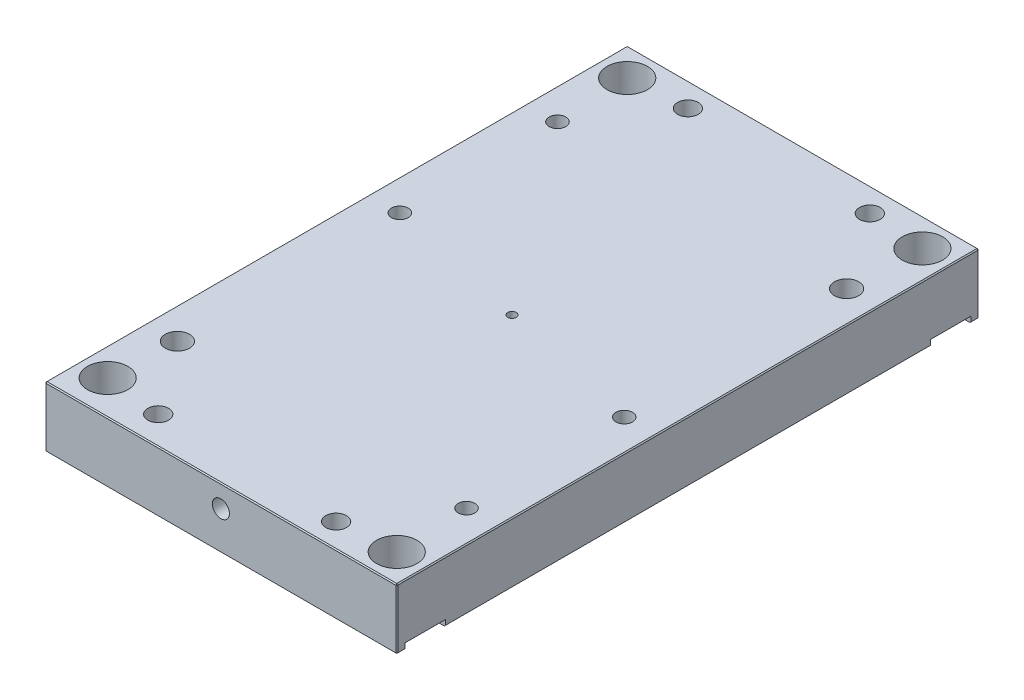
ISO-10303-21;
HEADER;
FILE_DESCRIPTION(('STEP AP214'),'2;1');
FILE_NAME('part.step','',(''),(''),'','','');
FILE_SCHEMA(('AUTOMOTIVE_DESIGN { 1 0 10303 214 1 1 1 1 }'));
ENDSEC;
DATA;
#1=APPLICATION_CONTEXT('core data for automotive mechanical design processes');
#2=APPLICATION_PROTOCOL_DEFINITION('international standard','automotive_design',2000,#1);
#3=PRODUCT_CONTEXT('',#1,'mechanical');
#4=PRODUCT('Part','Part','',(#3));
#5=PRODUCT_RELATED_PRODUCT_CATEGORY('part','',(#4));
#6=PRODUCT_DEFINITION_FORMATION('','',#4);
#7=PRODUCT_DEFINITION_CONTEXT('part definition',#1,'design');
#8=PRODUCT_DEFINITION('design','',#6,#7);
#9=PRODUCT_DEFINITION_SHAPE('','',#8);
#10=(LENGTH_UNIT() NAMED_UNIT(*) SI_UNIT(.MILLI.,.METRE.));
#11=(NAMED_UNIT(*) PLANE_ANGLE_UNIT() SI_UNIT($,.RADIAN.));
#12=(NAMED_UNIT(*) SI_UNIT($,.STERADIAN.) SOLID_ANGLE_UNIT());
#13=UNCERTAINTY_MEASURE_WITH_UNIT(LENGTH_MEASURE(1.E-05),#10,'distance_accuracy_value','');
#14=(GEOMETRIC_REPRESENTATION_CONTEXT(3) GLOBAL_UNCERTAINTY_ASSIGNED_CONTEXT((#13)) GLOBAL_UNIT_ASSIGNED_CONTEXT((#10,
#11,#12)) REPRESENTATION_CONTEXT('',''));
#15=CARTESIAN_POINT('',(0.,0.,0.));
#16=DIRECTION('',(0.,0.,1.));
#17=DIRECTION('',(1.,0.,0.));
#18=AXIS2_PLACEMENT_3D('',#15,#16,#17);
#19=CARTESIAN_POINT('',(138.1125,-47.625,228.6));
#20=DIRECTION('',(0.,-1.,0.));
#21=DIRECTION('',(1.,0.,0.));
#22=AXIS2_PLACEMENT_3D('',#19,#20,#21);
#23=PLANE('',#22);
#24=CARTESIAN_POINT('',(-113.50625,-47.625,-25.4));
#25=DIRECTION('',(0.,1.,0.));
#26=DIRECTION('',(0.,0.,1.));
#27=AXIS2_PLACEMENT_3D('',#24,#25,#26);
#28=CIRCLE('',#27,6.54812000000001);
#29=CARTESIAN_POINT('',(-113.50625,-47.625,-18.85188));
#30=VERTEX_POINT('',#29);
#31=EDGE_CURVE('E373',#30,#30,#28,.T.);
#32=ORIENTED_EDGE('',*,*,#31,.T.);
#33=EDGE_LOOP('',(#32));
#34=FACE_BOUND('',#33,.T.);
#35=CARTESIAN_POINT('',(113.50625,-47.625,25.4));
#36=DIRECTION('',(0.,1.,0.));
#37=DIRECTION('',(0.,0.,1.));
#38=AXIS2_PLACEMENT_3D('',#35,#36,#37);
#39=CIRCLE('',#38,6.54812000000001);
#40=CARTESIAN_POINT('',(113.50625,-47.625,31.94812));
#41=VERTEX_POINT('',#40);
#42=EDGE_CURVE('E381',#41,#41,#39,.T.);
#43=ORIENTED_EDGE('',*,*,#42,.T.);
#44=EDGE_LOOP('',(#43));
#45=FACE_BOUND('',#44,.T.);
#46=CARTESIAN_POINT('',(-113.50625,-47.625,-149.225));
#47=DIRECTION('',(0.,1.,0.));
#48=DIRECTION('',(0.,0.,1.));
#49=AXIS2_PLACEMENT_3D('',#46,#47,#48);
#50=CIRCLE('',#49,6.54812);
#51=CARTESIAN_POINT('',(-113.50625,-47.625,-142.67688));
#52=VERTEX_POINT('',#51);
#53=EDGE_CURVE('E387',#52,#52,#50,.T.);
#54=ORIENTED_EDGE('',*,*,#53,.T.);
#55=EDGE_LOOP('',(#54));
#56=FACE_BOUND('',#55,.T.);
#57=CARTESIAN_POINT('',(-113.50625,-47.625,149.225));
#58=DIRECTION('',(0.,1.,0.));
#59=DIRECTION('',(0.,0.,1.));
#60=AXIS2_PLACEMENT_3D('',#57,#58,#59);
#61=CIRCLE('',#60,9.525);
#62=CARTESIAN_POINT('',(-113.50625,-47.625,158.75));
#63=VERTEX_POINT('',#62);
#64=EDGE_CURVE('E393',#63,#63,#61,.T.);
#65=ORIENTED_EDGE('',*,*,#64,.T.);
#66=EDGE_LOOP('',(#65));
#67=FACE_BOUND('',#66,.T.);
#68=CARTESIAN_POINT('',(113.50625,-47.625,149.225));
#69=DIRECTION('',(0.,1.,0.));
#70=DIRECTION('',(0.,0.,1.));
#71=AXIS2_PLACEMENT_3D('',#68,#69,#70);
#72=CIRCLE('',#71,6.54812);
#73=CARTESIAN_POINT('',(113.50625,-47.625,155.77312));
#74=VERTEX_POINT('',#73);
#75=EDGE_CURVE('E399',#74,#74,#72,.T.);
#76=ORIENTED_EDGE('',*,*,#75,.T.);
#77=EDGE_LOOP('',(#76));
#78=FACE_BOUND('',#77,.T.);
#79=CARTESIAN_POINT('',(113.50625,-47.625,-149.225));
#80=DIRECTION('',(0.,1.,0.));
#81=DIRECTION('',(0.,0.,1.));
#82=AXIS2_PLACEMENT_3D('',#79,#80,#81);
#83=CIRCLE('',#82,9.52500000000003);
#84=CARTESIAN_POINT('',(113.50625,-47.625,-139.7));
#85=VERTEX_POINT('',#84);
#86=EDGE_CURVE('E405',#85,#85,#83,.T.);
#87=ORIENTED_EDGE('',*,*,#86,.T.);
#88=EDGE_LOOP('',(#87));
#89=FACE_BOUND('',#88,.T.);
#90=CARTESIAN_POINT('',(-71.4375,-47.625,-209.55));
#91=DIRECTION('',(0.,1.,0.));
#92=DIRECTION('',(0.,0.,1.));
#93=AXIS2_PLACEMENT_3D('',#90,#91,#92);
#94=CIRCLE('',#93,8.1359375);
#95=CARTESIAN_POINT('',(-71.4375,-47.625,-201.4140625));
#96=VERTEX_POINT('',#95);
#97=EDGE_CURVE('E411',#96,#96,#94,.T.);
#98=ORIENTED_EDGE('',*,*,#97,.T.);
#99=EDGE_LOOP('',(#98));
#100=FACE_BOUND('',#99,.T.);
#101=CARTESIAN_POINT('',(-71.4375,-47.625,206.375));
#102=DIRECTION('',(0.,1.,0.));
#103=DIRECTION('',(0.,0.,1.));
#104=AXIS2_PLACEMENT_3D('',#101,#102,#103);
#105=CIRCLE('',#104,8.1359375);
#106=CARTESIAN_POINT('',(-71.4375,-47.625,214.5109375));
#107=VERTEX_POINT('',#106);
#108=EDGE_CURVE('E417',#107,#107,#105,.T.);
#109=ORIENTED_EDGE('',*,*,#108,.T.);
#110=EDGE_LOOP('',(#109));
#111=FACE_BOUND('',#110,.T.);
#112=CARTESIAN_POINT('',(71.4375,-47.625,209.55));
#113=DIRECTION('',(0.,1.,0.));
#114=DIRECTION('',(0.,0.,1.));
#115=AXIS2_PLACEMENT_3D('',#112,#113,#114);
#116=CIRCLE('',#115,8.1359375);
#117=CARTESIAN_POINT('',(71.4375,-47.625,217.6859375));
#118=VERTEX_POINT('',#117);
#119=EDGE_CURVE('E423',#118,#118,#116,.T.);
#120=ORIENTED_EDGE('',*,*,#119,.T.);
#121=EDGE_LOOP('',(#120));
#122=FACE_BOUND('',#121,.T.);
#123=CARTESIAN_POINT('',(71.4375,-47.625,-209.55));
#124=DIRECTION('',(0.,1.,0.));
#125=DIRECTION('',(0.,0.,1.));
#126=AXIS2_PLACEMENT_3D('',#123,#124,#125);
#127=CIRCLE('',#126,8.1359375);
#128=CARTESIAN_POINT('',(71.4375,-47.625,-201.4140625));
#129=VERTEX_POINT('',#128);
#130=EDGE_CURVE('E429',#129,#129,#127,.T.);
#131=ORIENTED_EDGE('',*,*,#130,.T.);
#132=EDGE_LOOP('',(#131));
#133=FACE_BOUND('',#132,.T.);
#134=CARTESIAN_POINT('',(0.,-47.625,0.));
#135=DIRECTION('',(0.,1.,0.));
#136=DIRECTION('',(0.,0.,1.));
#137=AXIS2_PLACEMENT_3D('',#134,#135,#136);
#138=CIRCLE('',#137,3.3655);
#139=CARTESIAN_POINT('',(0.,-47.625,3.3655));
#140=VERTEX_POINT('',#139);
#141=EDGE_CURVE('E459',#140,#140,#138,.T.);
#142=ORIENTED_EDGE('',*,*,#141,.T.);
#143=EDGE_LOOP('',(#142));
#144=FACE_BOUND('',#143,.T.);
#145=CARTESIAN_POINT('',(-115.8875,-47.625,201.6125));
#146=DIRECTION('',(0.,1.,0.));
#147=DIRECTION('',(0.,0.,1.));
#148=AXIS2_PLACEMENT_3D('',#145,#146,#147);
#149=CIRCLE('',#148,15.88135);
#150=CARTESIAN_POINT('',(-115.8875,-47.625,217.49385));
#151=VERTEX_POINT('',#150);
#152=CARTESIAN_POINT('',(-115.8875,-47.625,185.73115));
#153=VERTEX_POINT('',#152);
#154=EDGE_CURVE('E441',#151,#153,#149,.T.);
#155=ORIENTED_EDGE('',*,*,#154,.T.);
#156=DIRECTION('',(1.,0.,0.));
#157=VECTOR('',#156,1.);
#158=CARTESIAN_POINT('',(-138.1125,-47.625,185.73115));
#159=LINE('',#158,#157);
#160=CARTESIAN_POINT('',(-137.31875,-47.625,185.73115));
#161=VERTEX_POINT('',#160);
#162=EDGE_CURVE('E283',#161,#153,#159,.T.);
#163=ORIENTED_EDGE('',*,*,#162,.F.);
#164=DIRECTION('',(0.,0.,-1.));
#165=VECTOR('',#164,1.);
#166=CARTESIAN_POINT('',(-137.31875,-47.625,-228.6));
#167=LINE('',#166,#165);
#168=CARTESIAN_POINT('',(-137.31875,-47.625,-190.49365));
#169=VERTEX_POINT('',#168);
#170=EDGE_CURVE('E489',#161,#169,#167,.T.);
#171=ORIENTED_EDGE('',*,*,#170,.T.);
#172=DIRECTION('',(1.,0.,0.));
#173=VECTOR('',#172,1.);
#174=CARTESIAN_POINT('',(138.1125,-47.625,-190.49365));
#175=LINE('',#174,#173);
#176=CARTESIAN_POINT('',(-115.8875,-47.625,-190.49365));
#177=VERTEX_POINT('',#176);
#178=EDGE_CURVE('E309',#169,#177,#175,.T.);
#179=ORIENTED_EDGE('',*,*,#178,.T.);
#180=CARTESIAN_POINT('',(-115.8875,-47.625,-206.375));
#181=DIRECTION('',(0.,1.,0.));
#182=DIRECTION('',(0.,0.,1.));
#183=AXIS2_PLACEMENT_3D('',#180,#181,#182);
#184=CIRCLE('',#183,15.88135);
#185=CARTESIAN_POINT('',(-115.8875,-47.625,-222.25635));
#186=VERTEX_POINT('',#185);
#187=EDGE_CURVE('E435',#177,#186,#184,.T.);
#188=ORIENTED_EDGE('',*,*,#187,.T.);
#189=DIRECTION('',(-1.,0.,0.));
#190=VECTOR('',#189,1.);
#191=CARTESIAN_POINT('',(138.1125,-47.625,-222.25635));
#192=LINE('',#191,#190);
#193=CARTESIAN_POINT('',(-137.31875,-47.625,-222.25635));
#194=VERTEX_POINT('',#193);
#195=EDGE_CURVE('E305',#186,#194,#192,.T.);
#196=ORIENTED_EDGE('',*,*,#195,.T.);
#197=CARTESIAN_POINT('',(-137.31875,-47.625,-227.80625));
#198=VERTEX_POINT('',#197);
#199=EDGE_CURVE('E484',#194,#198,#167,.T.);
#200=ORIENTED_EDGE('',*,*,#199,.T.);
#201=DIRECTION('',(1.,0.,0.));
#202=VECTOR('',#201,1.);
#203=CARTESIAN_POINT('',(138.1125,-47.625,-227.80625));
#204=LINE('',#203,#202);
#205=CARTESIAN_POINT('',(137.31875,-47.625,-227.80625));
#206=VERTEX_POINT('',#205);
#207=EDGE_CURVE('E482',#198,#206,#204,.T.);
#208=ORIENTED_EDGE('',*,*,#207,.T.);
#209=DIRECTION('',(0.,0.,1.));
#210=VECTOR('',#209,1.);
#211=CARTESIAN_POINT('',(137.31875,-47.625,228.6));
#212=LINE('',#211,#210);
#213=CARTESIAN_POINT('',(137.31875,-47.625,-222.25635));
#214=VERTEX_POINT('',#213);
#215=EDGE_CURVE('E490',#206,#214,#212,.T.);
#216=ORIENTED_EDGE('',*,*,#215,.T.);
#217=DIRECTION('',(1.,0.,0.));
#218=VECTOR('',#217,1.);
#219=CARTESIAN_POINT('',(138.1125,-47.625,-222.25635));
#220=LINE('',#219,#218);
#221=CARTESIAN_POINT('',(115.8875,-47.625,-222.25635));
#222=VERTEX_POINT('',#221);
#223=EDGE_CURVE('E354',#222,#214,#220,.T.);
#224=ORIENTED_EDGE('',*,*,#223,.F.);
#225=CARTESIAN_POINT('',(115.8875,-47.625,-206.375));
#226=DIRECTION('',(0.,1.,0.));
#227=DIRECTION('',(0.,0.,1.));
#228=AXIS2_PLACEMENT_3D('',#225,#226,#227);
#229=CIRCLE('',#228,15.88135);
#230=CARTESIAN_POINT('',(115.8875,-47.625,-190.49365));
#231=VERTEX_POINT('',#230);
#232=EDGE_CURVE('E453',#222,#231,#229,.T.);
#233=ORIENTED_EDGE('',*,*,#232,.T.);
#234=DIRECTION('',(-1.,0.,0.));
#235=VECTOR('',#234,1.);
#236=CARTESIAN_POINT('',(138.1125,-47.625,-190.49365));
#237=LINE('',#236,#235);
#238=CARTESIAN_POINT('',(137.31875,-47.625,-190.49365));
#239=VERTEX_POINT('',#238);
#240=EDGE_CURVE('E358',#239,#231,#237,.T.);
#241=ORIENTED_EDGE('',*,*,#240,.F.);
#242=CARTESIAN_POINT('',(137.31875,-47.625,190.49365));
#243=VERTEX_POINT('',#242);
#244=EDGE_CURVE('E494',#239,#243,#212,.T.);
#245=ORIENTED_EDGE('',*,*,#244,.T.);
#246=DIRECTION('',(-1.,0.,0.));
#247=VECTOR('',#246,1.);
#248=CARTESIAN_POINT('',(138.1125,-47.625,190.49365));
#249=LINE('',#248,#247);
#250=CARTESIAN_POINT('',(115.8875,-47.625,190.49365));
#251=VERTEX_POINT('',#250);
#252=EDGE_CURVE('E332',#243,#251,#249,.T.);
#253=ORIENTED_EDGE('',*,*,#252,.T.);
#254=CARTESIAN_POINT('',(115.8875,-47.625,206.375));
#255=DIRECTION('',(0.,1.,0.));
#256=DIRECTION('',(0.,0.,1.));
#257=AXIS2_PLACEMENT_3D('',#254,#255,#256);
#258=CIRCLE('',#257,15.88135);
#259=CARTESIAN_POINT('',(115.8875,-47.625,222.25635));
#260=VERTEX_POINT('',#259);
#261=EDGE_CURVE('E447',#251,#260,#258,.T.);
#262=ORIENTED_EDGE('',*,*,#261,.T.);
#263=DIRECTION('',(1.,0.,0.));
#264=VECTOR('',#263,1.);
#265=CARTESIAN_POINT('',(138.1125,-47.625,222.25635));
#266=LINE('',#265,#264);
#267=CARTESIAN_POINT('',(137.31875,-47.625,222.25635));
#268=VERTEX_POINT('',#267);
#269=EDGE_CURVE('E325',#260,#268,#266,.T.);
#270=ORIENTED_EDGE('',*,*,#269,.T.);
#271=CARTESIAN_POINT('',(137.31875,-47.625,227.80625));
#272=VERTEX_POINT('',#271);
#273=EDGE_CURVE('E488',#268,#272,#212,.T.);
#274=ORIENTED_EDGE('',*,*,#273,.T.);
#275=DIRECTION('',(-1.,0.,0.));
#276=VECTOR('',#275,1.);
#277=CARTESIAN_POINT('',(138.1125,-47.625,227.80625));
#278=LINE('',#277,#276);
#279=CARTESIAN_POINT('',(-137.31875,-47.625,227.80625));
#280=VERTEX_POINT('',#279);
#281=EDGE_CURVE('E493',#272,#280,#278,.T.);
#282=ORIENTED_EDGE('',*,*,#281,.T.);
#283=CARTESIAN_POINT('',(-137.31875,-47.625,217.49385));
#284=VERTEX_POINT('',#283);
#285=EDGE_CURVE('E485',#280,#284,#167,.T.);
#286=ORIENTED_EDGE('',*,*,#285,.T.);
#287=DIRECTION('',(1.,0.,0.));
#288=VECTOR('',#287,1.);
#289=CARTESIAN_POINT('',(-138.1125,-47.625,217.49385));
#290=LINE('',#289,#288);
#291=EDGE_CURVE('E267',#284,#151,#290,.T.);
#292=ORIENTED_EDGE('',*,*,#291,.T.);
#293=EDGE_LOOP('',(#155,#163,#171,#179,#188,#196,#200,#208,#216,#224,#233,#241,#245,#253,#262,
#270,#274,#282,#286,#292));
#294=FACE_BOUND('',#293,.T.);
#295=ADVANCED_FACE('F39',(#34,#45,#56,#67,#78,#89,#100,#111,#122,#133,#144,#294),#23,.T.);
#296=CARTESIAN_POINT('',(-138.1125,0.,228.6));
#297=DIRECTION('',(1.,0.,0.));
#298=DIRECTION('',(0.,1.,0.));
#299=AXIS2_PLACEMENT_3D('',#296,#297,#298);
#300=PLANE('',#299);
#301=DIRECTION('',(0.,-1.,0.));
#302=VECTOR('',#301,1.);
#303=CARTESIAN_POINT('',(-138.1125,-42.8625,185.73115));
#304=LINE('',#303,#302);
#305=CARTESIAN_POINT('',(-138.1125,-42.8625,185.73115));
#306=VERTEX_POINT('',#305);
#307=CARTESIAN_POINT('',(-138.1125,-46.8312499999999,185.73115));
#308=VERTEX_POINT('',#307);
#309=EDGE_CURVE('E260',#306,#308,#304,.T.);
#310=ORIENTED_EDGE('',*,*,#309,.F.);
#311=DIRECTION('',(0.,0.,1.));
#312=VECTOR('',#311,1.);
#313=CARTESIAN_POINT('',(-138.1125,-42.8625,185.73115));
#314=LINE('',#313,#312);
#315=CARTESIAN_POINT('',(-138.1125,-42.8625,217.49385));
#316=VERTEX_POINT('',#315);
#317=EDGE_CURVE('E259',#306,#316,#314,.T.);
#318=ORIENTED_EDGE('',*,*,#317,.T.);
#319=DIRECTION('',(0.,1.,0.));
#320=VECTOR('',#319,1.);
#321=CARTESIAN_POINT('',(-138.1125,-47.625,217.49385));
#322=LINE('',#321,#320);
#323=CARTESIAN_POINT('',(-138.1125,-46.8312499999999,217.49385));
#324=VERTEX_POINT('',#323);
#325=EDGE_CURVE('E252',#324,#316,#322,.T.);
#326=ORIENTED_EDGE('',*,*,#325,.F.);
#327=DIRECTION('',(0.,0.,1.));
#328=VECTOR('',#327,1.);
#329=CARTESIAN_POINT('',(-138.1125,-46.83125,228.6));
#330=LINE('',#329,#328);
#331=CARTESIAN_POINT('',(-138.1125,-46.83125,227.80625));
#332=VERTEX_POINT('',#331);
#333=EDGE_CURVE('E510',#324,#332,#330,.T.);
#334=ORIENTED_EDGE('',*,*,#333,.T.);
#335=DIRECTION('',(0.,1.,0.));
#336=VECTOR('',#335,1.);
#337=CARTESIAN_POINT('',(-138.1125,0.,227.80625));
#338=LINE('',#337,#336);
#339=CARTESIAN_POINT('',(-138.1125,-0.793750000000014,227.80625));
#340=VERTEX_POINT('',#339);
#341=EDGE_CURVE('E514',#332,#340,#338,.T.);
#342=ORIENTED_EDGE('',*,*,#341,.T.);
#343=DIRECTION('',(0.,0.,-1.));
#344=VECTOR('',#343,1.);
#345=CARTESIAN_POINT('',(-138.1125,-0.793750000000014,-228.6));
#346=LINE('',#345,#344);
#347=CARTESIAN_POINT('',(-138.1125,-0.793750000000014,-227.80625));
#348=VERTEX_POINT('',#347);
#349=EDGE_CURVE('E517',#340,#348,#346,.T.);
#350=ORIENTED_EDGE('',*,*,#349,.T.);
#351=DIRECTION('',(0.,-1.,0.));
#352=VECTOR('',#351,1.);
#353=CARTESIAN_POINT('',(-138.1125,0.,-227.80625));
#354=LINE('',#353,#352);
#355=CARTESIAN_POINT('',(-138.1125,-46.83125,-227.80625));
#356=VERTEX_POINT('',#355);
#357=EDGE_CURVE('E507',#348,#356,#354,.T.);
#358=ORIENTED_EDGE('',*,*,#357,.T.);
#359=CARTESIAN_POINT('',(-138.1125,-46.83125,-222.25635));
#360=VERTEX_POINT('',#359);
#361=EDGE_CURVE('E511',#356,#360,#330,.T.);
#362=ORIENTED_EDGE('',*,*,#361,.T.);
#363=DIRECTION('',(0.,-1.,0.));
#364=VECTOR('',#363,1.);
#365=CARTESIAN_POINT('',(-138.1125,-42.8625,-222.25635));
#366=LINE('',#365,#364);
#367=CARTESIAN_POINT('',(-138.1125,-42.8625,-222.25635));
#368=VERTEX_POINT('',#367);
#369=EDGE_CURVE('E62',#368,#360,#366,.T.);
#370=ORIENTED_EDGE('',*,*,#369,.F.);
#371=DIRECTION('',(0.,0.,1.));
#372=VECTOR('',#371,1.);
#373=CARTESIAN_POINT('',(-138.1125,-42.8625,-222.25635));
#374=LINE('',#373,#372);
#375=CARTESIAN_POINT('',(-138.1125,-42.8625,-190.49365));
#376=VERTEX_POINT('',#375);
#377=EDGE_CURVE('E294',#368,#376,#374,.T.);
#378=ORIENTED_EDGE('',*,*,#377,.T.);
#379=DIRECTION('',(0.,1.,0.));
#380=VECTOR('',#379,1.);
#381=CARTESIAN_POINT('',(-138.1125,-52.3875,-190.49365));
#382=LINE('',#381,#380);
#383=CARTESIAN_POINT('',(-138.1125,-46.8312499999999,-190.49365));
#384=VERTEX_POINT('',#383);
#385=EDGE_CURVE('E290',#384,#376,#382,.T.);
#386=ORIENTED_EDGE('',*,*,#385,.F.);
#387=EDGE_CURVE('E515',#384,#308,#330,.T.);
#388=ORIENTED_EDGE('',*,*,#387,.T.);
#389=EDGE_LOOP('',(#310,#318,#326,#334,#342,#350,#358,#362,#370,#378,#386,#388));
#390=FACE_BOUND('',#389,.T.);
#391=ADVANCED_FACE('F270',(#390),#300,.F.);
#392=CARTESIAN_POINT('',(-137.31875,-47.625,228.6));
#393=DIRECTION('',(-0.707106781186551,-0.707106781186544,0.));
#394=DIRECTION('',(0.707106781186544,-0.707106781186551,0.));
#395=AXIS2_PLACEMENT_3D('',#392,#393,#394);
#396=PLANE('',#395);
#397=ORIENTED_EDGE('',*,*,#170,.F.);
#398=DIRECTION('',(-0.707106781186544,0.707106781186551,0.));
#399=VECTOR('',#398,1.);
#400=CARTESIAN_POINT('',(-137.31875,-47.6250000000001,185.73115));
#401=LINE('',#400,#399);
#402=EDGE_CURVE('E286',#161,#308,#401,.T.);
#403=ORIENTED_EDGE('',*,*,#402,.T.);
#404=ORIENTED_EDGE('',*,*,#387,.F.);
#405=DIRECTION('',(0.707106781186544,-0.707106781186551,0.));
#406=VECTOR('',#405,1.);
#407=CARTESIAN_POINT('',(-137.31875,-47.625,-190.49365));
#408=LINE('',#407,#406);
#409=EDGE_CURVE('E609',#384,#169,#408,.T.);
#410=ORIENTED_EDGE('',*,*,#409,.T.);
#411=EDGE_LOOP('',(#397,#403,#404,#410));
#412=FACE_BOUND('',#411,.T.);
#413=ADVANCED_FACE('F628',(#412),#396,.T.);
#414=ORIENTED_EDGE('',*,*,#333,.F.);
#415=DIRECTION('',(0.707106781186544,-0.707106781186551,0.));
#416=VECTOR('',#415,1.);
#417=CARTESIAN_POINT('',(-137.31875,-47.6249999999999,217.49385));
#418=LINE('',#417,#416);
#419=EDGE_CURVE('E255',#324,#284,#418,.T.);
#420=ORIENTED_EDGE('',*,*,#419,.T.);
#421=ORIENTED_EDGE('',*,*,#285,.F.);
#422=DIRECTION('',(0.707106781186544,-0.707106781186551,0.));
#423=VECTOR('',#422,1.);
#424=CARTESIAN_POINT('',(-137.31875,-47.625,227.80625));
#425=LINE('',#424,#423);
#426=EDGE_CURVE('E574',#332,#280,#425,.T.);
#427=ORIENTED_EDGE('',*,*,#426,.F.);
#428=EDGE_LOOP('',(#414,#420,#421,#427));
#429=FACE_BOUND('',#428,.T.);
#430=ADVANCED_FACE('F635',(#429),#396,.T.);
#431=ORIENTED_EDGE('',*,*,#199,.F.);
#432=DIRECTION('',(-0.707106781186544,0.707106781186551,0.));
#433=VECTOR('',#432,1.);
#434=CARTESIAN_POINT('',(-137.31875,-47.625,-222.25635));
#435=LINE('',#434,#433);
#436=EDGE_CURVE('E607',#194,#360,#435,.T.);
#437=ORIENTED_EDGE('',*,*,#436,.T.);
#438=ORIENTED_EDGE('',*,*,#361,.F.);
#439=DIRECTION('',(-0.707106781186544,0.707106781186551,0.));
#440=VECTOR('',#439,1.);
#441=CARTESIAN_POINT('',(-137.31875,-47.625,-227.80625));
#442=LINE('',#441,#440);
#443=EDGE_CURVE('E588',#356,#198,#442,.F.);
#444=ORIENTED_EDGE('',*,*,#443,.T.);
#445=EDGE_LOOP('',(#431,#437,#438,#444));
#446=FACE_BOUND('',#445,.T.);
#447=ADVANCED_FACE('F664',(#446),#396,.T.);
#448=CARTESIAN_POINT('',(138.1125,-46.83125,228.6));
#449=DIRECTION('',(0.707106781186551,-0.707106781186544,0.));
#450=DIRECTION('',(0.707106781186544,0.707106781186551,0.));
#451=AXIS2_PLACEMENT_3D('',#448,#449,#450);
#452=PLANE('',#451);
#453=DIRECTION('',(0.,0.,-1.));
#454=VECTOR('',#453,1.);
#455=CARTESIAN_POINT('',(138.1125,-46.83125,-228.6));
#456=LINE('',#455,#454);
#457=CARTESIAN_POINT('',(138.1125,-46.83125,190.49365));
#458=VERTEX_POINT('',#457);
#459=CARTESIAN_POINT('',(138.1125,-46.83125,-190.49365));
#460=VERTEX_POINT('',#459);
#461=EDGE_CURVE('E508',#458,#460,#456,.T.);
#462=ORIENTED_EDGE('',*,*,#461,.F.);
#463=DIRECTION('',(-0.707106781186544,-0.707106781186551,0.));
#464=VECTOR('',#463,1.);
#465=CARTESIAN_POINT('',(138.1125,-46.83125,190.49365));
#466=LINE('',#465,#464);
#467=EDGE_CURVE('E335',#458,#243,#466,.T.);
#468=ORIENTED_EDGE('',*,*,#467,.T.);
#469=ORIENTED_EDGE('',*,*,#244,.F.);
#470=DIRECTION('',(-0.707106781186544,-0.707106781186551,0.));
#471=VECTOR('',#470,1.);
#472=CARTESIAN_POINT('',(138.1125,-46.83125,-190.49365));
#473=LINE('',#472,#471);
#474=EDGE_CURVE('E597',#460,#239,#473,.T.);
#475=ORIENTED_EDGE('',*,*,#474,.F.);
#476=EDGE_LOOP('',(#462,#468,#469,#475));
#477=FACE_BOUND('',#476,.T.);
#478=ADVANCED_FACE('F955',(#477),#452,.T.);
#479=ORIENTED_EDGE('',*,*,#273,.F.);
#480=DIRECTION('',(0.707106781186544,0.707106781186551,0.));
#481=VECTOR('',#480,1.);
#482=CARTESIAN_POINT('',(138.1125,-46.83125,222.25635));
#483=LINE('',#482,#481);
#484=CARTESIAN_POINT('',(138.1125,-46.83125,222.25635));
#485=VERTEX_POINT('',#484);
#486=EDGE_CURVE('E329',#268,#485,#483,.T.);
#487=ORIENTED_EDGE('',*,*,#486,.T.);
#488=CARTESIAN_POINT('',(138.1125,-46.83125,227.80625));
#489=VERTEX_POINT('',#488);
#490=EDGE_CURVE('E504',#489,#485,#456,.T.);
#491=ORIENTED_EDGE('',*,*,#490,.F.);
#492=DIRECTION('',(0.707106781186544,0.707106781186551,0.));
#493=VECTOR('',#492,1.);
#494=CARTESIAN_POINT('',(137.715625,-47.228125,227.80625));
#495=LINE('',#494,#493);
#496=EDGE_CURVE('E559',#272,#489,#495,.T.);
#497=ORIENTED_EDGE('',*,*,#496,.F.);
#498=EDGE_LOOP('',(#479,#487,#491,#497));
#499=FACE_BOUND('',#498,.T.);
#500=ADVANCED_FACE('F686',(#499),#452,.T.);
#501=CARTESIAN_POINT('',(138.1125,-47.625,228.6));
#502=DIRECTION('',(-1.,0.,0.));
#503=DIRECTION('',(0.,0.,1.));
#504=AXIS2_PLACEMENT_3D('',#501,#502,#503);
#505=PLANE('',#504);
#506=DIRECTION('',(0.,1.,0.));
#507=VECTOR('',#506,1.);
#508=CARTESIAN_POINT('',(138.1125,-52.3875,190.49365));
#509=LINE('',#508,#507);
#510=CARTESIAN_POINT('',(138.1125,-42.8625,190.49365));
#511=VERTEX_POINT('',#510);
#512=EDGE_CURVE('E313',#458,#511,#509,.T.);
#513=ORIENTED_EDGE('',*,*,#512,.F.);
#514=ORIENTED_EDGE('',*,*,#461,.T.);
#515=DIRECTION('',(0.,1.,0.));
#516=VECTOR('',#515,1.);
#517=CARTESIAN_POINT('',(138.1125,-52.3875,-190.49365));
#518=LINE('',#517,#516);
#519=CARTESIAN_POINT('',(138.1125,-42.8625,-190.49365));
#520=VERTEX_POINT('',#519);
#521=EDGE_CURVE('E339',#460,#520,#518,.T.);
#522=ORIENTED_EDGE('',*,*,#521,.T.);
#523=DIRECTION('',(0.,0.,1.));
#524=VECTOR('',#523,1.);
#525=CARTESIAN_POINT('',(138.1125,-42.8625,-222.25635));
#526=LINE('',#525,#524);
#527=CARTESIAN_POINT('',(138.1125,-42.8625,-222.25635));
#528=VERTEX_POINT('',#527);
#529=EDGE_CURVE('E342',#528,#520,#526,.T.);
#530=ORIENTED_EDGE('',*,*,#529,.F.);
#531=DIRECTION('',(0.,-1.,0.));
#532=VECTOR('',#531,1.);
#533=CARTESIAN_POINT('',(138.1125,-42.8625,-222.25635));
#534=LINE('',#533,#532);
#535=CARTESIAN_POINT('',(138.1125,-46.83125,-222.25635));
#536=VERTEX_POINT('',#535);
#537=EDGE_CURVE('E345',#528,#536,#534,.T.);
#538=ORIENTED_EDGE('',*,*,#537,.T.);
#539=CARTESIAN_POINT('',(138.1125,-46.83125,-227.80625));
#540=VERTEX_POINT('',#539);
#541=EDGE_CURVE('E503',#536,#540,#456,.T.);
#542=ORIENTED_EDGE('',*,*,#541,.T.);
#543=DIRECTION('',(0.,1.,0.));
#544=VECTOR('',#543,1.);
#545=CARTESIAN_POINT('',(138.1125,-47.625,-227.80625));
#546=LINE('',#545,#544);
#547=CARTESIAN_POINT('',(138.1125,-0.793750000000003,-227.80625));
#548=VERTEX_POINT('',#547);
#549=EDGE_CURVE('E497',#540,#548,#546,.T.);
#550=ORIENTED_EDGE('',*,*,#549,.T.);
#551=DIRECTION('',(0.,0.,1.));
#552=VECTOR('',#551,1.);
#553=CARTESIAN_POINT('',(138.1125,-0.793750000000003,228.6));
#554=LINE('',#553,#552);
#555=CARTESIAN_POINT('',(138.1125,-0.793750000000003,227.80625));
#556=VERTEX_POINT('',#555);
#557=EDGE_CURVE('E499',#548,#556,#554,.T.);
#558=ORIENTED_EDGE('',*,*,#557,.T.);
#559=DIRECTION('',(0.,-1.,0.));
#560=VECTOR('',#559,1.);
#561=CARTESIAN_POINT('',(138.1125,-47.625,227.80625));
#562=LINE('',#561,#560);
#563=EDGE_CURVE('E501',#556,#489,#562,.T.);
#564=ORIENTED_EDGE('',*,*,#563,.T.);
#565=ORIENTED_EDGE('',*,*,#490,.T.);
#566=DIRECTION('',(0.,-1.,0.));
#567=VECTOR('',#566,1.);
#568=CARTESIAN_POINT('',(138.1125,-42.8625,222.25635));
#569=LINE('',#568,#567);
#570=CARTESIAN_POINT('',(138.1125,-42.8625,222.25635));
#571=VERTEX_POINT('',#570);
#572=EDGE_CURVE('E315',#571,#485,#569,.T.);
#573=ORIENTED_EDGE('',*,*,#572,.F.);
#574=DIRECTION('',(0.,0.,-1.));
#575=VECTOR('',#574,1.);
#576=CARTESIAN_POINT('',(138.1125,-42.8625,222.25635));
#577=LINE('',#576,#575);
#578=EDGE_CURVE('E317',#571,#511,#577,.T.);
#579=ORIENTED_EDGE('',*,*,#578,.T.);
#580=EDGE_LOOP('',(#513,#514,#522,#530,#538,#542,#550,#558,#564,#565,#573,#579));
#581=FACE_BOUND('',#580,.T.);
#582=ADVANCED_FACE('F739',(#581),#505,.F.);
#583=CARTESIAN_POINT('',(-138.1125,0.,-228.6));
#584=DIRECTION('',(0.,0.,1.));
#585=DIRECTION('',(1.,0.,0.));
#586=AXIS2_PLACEMENT_3D('',#583,#584,#585);
#587=PLANE('',#586);
#588=DIRECTION('',(0.,-1.,0.));
#589=VECTOR('',#588,1.);
#590=CARTESIAN_POINT('',(137.31875,0.,-228.6));
#591=LINE('',#590,#589);
#592=CARTESIAN_POINT('',(137.31875,-0.793750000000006,-228.6));
#593=VERTEX_POINT('',#592);
#594=CARTESIAN_POINT('',(137.31875,-46.83125,-228.6));
#595=VERTEX_POINT('',#594);
#596=EDGE_CURVE('E524',#593,#595,#591,.T.);
#597=ORIENTED_EDGE('',*,*,#596,.T.);
#598=DIRECTION('',(-1.,0.,0.));
#599=VECTOR('',#598,1.);
#600=CARTESIAN_POINT('',(-138.1125,-46.83125,-228.6));
#601=LINE('',#600,#599);
#602=CARTESIAN_POINT('',(-137.31875,-46.83125,-228.6));
#603=VERTEX_POINT('',#602);
#604=EDGE_CURVE('E526',#595,#603,#601,.T.);
#605=ORIENTED_EDGE('',*,*,#604,.T.);
#606=DIRECTION('',(0.,1.,0.));
#607=VECTOR('',#606,1.);
#608=CARTESIAN_POINT('',(-137.31875,0.,-228.6));
#609=LINE('',#608,#607);
#610=CARTESIAN_POINT('',(-137.31875,-0.793750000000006,-228.6));
#611=VERTEX_POINT('',#610);
#612=EDGE_CURVE('E520',#603,#611,#609,.T.);
#613=ORIENTED_EDGE('',*,*,#612,.T.);
#614=DIRECTION('',(1.,0.,0.));
#615=VECTOR('',#614,1.);
#616=CARTESIAN_POINT('',(138.1125,-0.793750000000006,-228.6));
#617=LINE('',#616,#615);
#618=EDGE_CURVE('E522',#611,#593,#617,.T.);
#619=ORIENTED_EDGE('',*,*,#618,.T.);
#620=EDGE_LOOP('',(#597,#605,#613,#619));
#621=FACE_BOUND('',#620,.T.);
#622=CARTESIAN_POINT('',(0.,-17.4625,-228.6));
#623=DIRECTION('',(0.,0.,1.));
#624=DIRECTION('',(1.,0.,0.));
#625=AXIS2_PLACEMENT_3D('',#622,#623,#624);
#626=CIRCLE('',#625,6.7462341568);
#627=CARTESIAN_POINT('',(6.74623415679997,-17.4625,-228.6));
#628=VERTEX_POINT('',#627);
#629=EDGE_CURVE('E360',#628,#628,#626,.T.);
#630=ORIENTED_EDGE('',*,*,#629,.T.);
#631=EDGE_LOOP('',(#630));
#632=FACE_BOUND('',#631,.T.);
#633=ADVANCED_FACE('F982',(#621,#632),#587,.F.);
#634=CARTESIAN_POINT('',(-138.1125,0.,228.6));
#635=DIRECTION('',(0.,0.,1.));
#636=DIRECTION('',(1.,0.,0.));
#637=AXIS2_PLACEMENT_3D('',#634,#635,#636);
#638=PLANE('',#637);
#639=DIRECTION('',(1.,0.,0.));
#640=VECTOR('',#639,1.);
#641=CARTESIAN_POINT('',(-138.1125,-46.83125,228.6));
#642=LINE('',#641,#640);
#643=CARTESIAN_POINT('',(-137.31875,-46.83125,228.6));
#644=VERTEX_POINT('',#643);
#645=CARTESIAN_POINT('',(137.31875,-46.83125,228.6));
#646=VERTEX_POINT('',#645);
#647=EDGE_CURVE('E475',#644,#646,#642,.T.);
#648=ORIENTED_EDGE('',*,*,#647,.T.);
#649=DIRECTION('',(0.,1.,0.));
#650=VECTOR('',#649,1.);
#651=CARTESIAN_POINT('',(137.31875,0.,228.6));
#652=LINE('',#651,#650);
#653=CARTESIAN_POINT('',(137.31875,-0.793750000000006,228.6));
#654=VERTEX_POINT('',#653);
#655=EDGE_CURVE('E480',#646,#654,#652,.T.);
#656=ORIENTED_EDGE('',*,*,#655,.T.);
#657=DIRECTION('',(-1.,0.,0.));
#658=VECTOR('',#657,1.);
#659=CARTESIAN_POINT('',(-138.1125,-0.793750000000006,228.6));
#660=LINE('',#659,#658);
#661=CARTESIAN_POINT('',(-137.31875,-0.793750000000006,228.6));
#662=VERTEX_POINT('',#661);
#663=EDGE_CURVE('E477',#654,#662,#660,.T.);
#664=ORIENTED_EDGE('',*,*,#663,.T.);
#665=DIRECTION('',(0.,-1.,0.));
#666=VECTOR('',#665,1.);
#667=CARTESIAN_POINT('',(-137.31875,-47.625,228.6));
#668=LINE('',#667,#666);
#669=EDGE_CURVE('E473',#662,#644,#668,.T.);
#670=ORIENTED_EDGE('',*,*,#669,.T.);
#671=EDGE_LOOP('',(#648,#656,#664,#670));
#672=FACE_BOUND('',#671,.T.);
#673=CARTESIAN_POINT('',(0.,-17.4625,228.6));
#674=DIRECTION('',(0.,0.,1.));
#675=DIRECTION('',(1.,0.,0.));
#676=AXIS2_PLACEMENT_3D('',#673,#674,#675);
#677=CIRCLE('',#676,6.7462341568);
#678=CARTESIAN_POINT('',(6.74623415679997,-17.4625,228.6));
#679=VERTEX_POINT('',#678);
#680=EDGE_CURVE('E369',#679,#679,#677,.T.);
#681=ORIENTED_EDGE('',*,*,#680,.F.);
#682=EDGE_LOOP('',(#681));
#683=FACE_BOUND('',#682,.T.);
#684=ADVANCED_FACE('F696',(#672,#683),#638,.T.);
#685=CARTESIAN_POINT('',(-138.1125,0.,228.6));
#686=DIRECTION('',(0.,1.,0.));
#687=DIRECTION('',(0.,0.,1.));
#688=AXIS2_PLACEMENT_3D('',#685,#686,#687);
#689=PLANE('',#688);
#690=DIRECTION('',(0.,0.,1.));
#691=VECTOR('',#690,1.);
#692=CARTESIAN_POINT('',(-137.31875,0.,228.6));
#693=LINE('',#692,#691);
#694=CARTESIAN_POINT('',(-137.31875,0.,-227.80625));
#695=VERTEX_POINT('',#694);
#696=CARTESIAN_POINT('',(-137.31875,0.,227.80625));
#697=VERTEX_POINT('',#696);
#698=EDGE_CURVE('E466',#695,#697,#693,.T.);
#699=ORIENTED_EDGE('',*,*,#698,.T.);
#700=DIRECTION('',(1.,0.,0.));
#701=VECTOR('',#700,1.);
#702=CARTESIAN_POINT('',(-138.1125,0.,227.80625));
#703=LINE('',#702,#701);
#704=CARTESIAN_POINT('',(137.31875,0.,227.80625));
#705=VERTEX_POINT('',#704);
#706=EDGE_CURVE('E470',#697,#705,#703,.T.);
#707=ORIENTED_EDGE('',*,*,#706,.T.);
#708=DIRECTION('',(0.,0.,-1.));
#709=VECTOR('',#708,1.);
#710=CARTESIAN_POINT('',(137.31875,0.,-228.6));
#711=LINE('',#710,#709);
#712=CARTESIAN_POINT('',(137.31875,0.,-227.80625));
#713=VERTEX_POINT('',#712);
#714=EDGE_CURVE('E468',#705,#713,#711,.T.);
#715=ORIENTED_EDGE('',*,*,#714,.T.);
#716=DIRECTION('',(-1.,0.,0.));
#717=VECTOR('',#716,1.);
#718=CARTESIAN_POINT('',(-138.1125,0.,-227.80625));
#719=LINE('',#718,#717);
#720=EDGE_CURVE('E462',#713,#695,#719,.T.);
#721=ORIENTED_EDGE('',*,*,#720,.T.);
#722=EDGE_LOOP('',(#699,#707,#715,#721));
#723=FACE_BOUND('',#722,.T.);
#724=CARTESIAN_POINT('',(-113.50625,-1.13686837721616E-10,-25.4));
#725=DIRECTION('',(0.,1.,0.));
#726=DIRECTION('',(0.,0.,1.));
#727=AXIS2_PLACEMENT_3D('',#724,#725,#726);
#728=CIRCLE('',#727,6.54812000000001);
#729=CARTESIAN_POINT('',(-113.50625,-1.13686837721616E-10,-18.85188));
#730=VERTEX_POINT('',#729);
#731=EDGE_CURVE('E377',#730,#730,#728,.T.);
#732=ORIENTED_EDGE('',*,*,#731,.F.);
#733=EDGE_LOOP('',(#732));
#734=FACE_BOUND('',#733,.T.);
#735=CARTESIAN_POINT('',(113.50625,0.,25.4));
#736=DIRECTION('',(0.,1.,0.));
#737=DIRECTION('',(0.,0.,1.));
#738=AXIS2_PLACEMENT_3D('',#735,#736,#737);
#739=CIRCLE('',#738,6.54812000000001);
#740=CARTESIAN_POINT('',(113.50625,0.,31.94812));
#741=VERTEX_POINT('',#740);
#742=EDGE_CURVE('E376',#741,#741,#739,.T.);
#743=ORIENTED_EDGE('',*,*,#742,.F.);
#744=EDGE_LOOP('',(#743));
#745=FACE_BOUND('',#744,.T.);
#746=CARTESIAN_POINT('',(-113.50625,-5.6843418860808E-11,-149.225));
#747=DIRECTION('',(0.,1.,0.));
#748=DIRECTION('',(0.,0.,1.));
#749=AXIS2_PLACEMENT_3D('',#746,#747,#748);
#750=CIRCLE('',#749,6.54812);
#751=CARTESIAN_POINT('',(-113.50625,-5.6843418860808E-11,-142.67688));
#752=VERTEX_POINT('',#751);
#753=EDGE_CURVE('E384',#752,#752,#750,.T.);
#754=ORIENTED_EDGE('',*,*,#753,.F.);
#755=EDGE_LOOP('',(#754));
#756=FACE_BOUND('',#755,.T.);
#757=CARTESIAN_POINT('',(-113.50625,-5.6843418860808E-11,149.225));
#758=DIRECTION('',(0.,1.,0.));
#759=DIRECTION('',(0.,0.,1.));
#760=AXIS2_PLACEMENT_3D('',#757,#758,#759);
#761=CIRCLE('',#760,9.525);
#762=CARTESIAN_POINT('',(-113.50625,-5.6843418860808E-11,158.75));
#763=VERTEX_POINT('',#762);
#764=EDGE_CURVE('E390',#763,#763,#761,.T.);
#765=ORIENTED_EDGE('',*,*,#764,.F.);
#766=EDGE_LOOP('',(#765));
#767=FACE_BOUND('',#766,.T.);
#768=CARTESIAN_POINT('',(113.50625,0.,149.225));
#769=DIRECTION('',(0.,1.,0.));
#770=DIRECTION('',(0.,0.,1.));
#771=AXIS2_PLACEMENT_3D('',#768,#769,#770);
#772=CIRCLE('',#771,6.54812);
#773=CARTESIAN_POINT('',(113.50625,0.,155.77312));
#774=VERTEX_POINT('',#773);
#775=EDGE_CURVE('E396',#774,#774,#772,.T.);
#776=ORIENTED_EDGE('',*,*,#775,.F.);
#777=EDGE_LOOP('',(#776));
#778=FACE_BOUND('',#777,.T.);
#779=CARTESIAN_POINT('',(113.50625,0.,-149.225));
#780=DIRECTION('',(0.,1.,0.));
#781=DIRECTION('',(0.,0.,1.));
#782=AXIS2_PLACEMENT_3D('',#779,#780,#781);
#783=CIRCLE('',#782,9.52500000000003);
#784=CARTESIAN_POINT('',(113.50625,0.,-139.7));
#785=VERTEX_POINT('',#784);
#786=EDGE_CURVE('E402',#785,#785,#783,.T.);
#787=ORIENTED_EDGE('',*,*,#786,.F.);
#788=EDGE_LOOP('',(#787));
#789=FACE_BOUND('',#788,.T.);
#790=CARTESIAN_POINT('',(-71.4375,-5.6843418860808E-11,-209.55));
#791=DIRECTION('',(0.,1.,0.));
#792=DIRECTION('',(0.,0.,1.));
#793=AXIS2_PLACEMENT_3D('',#790,#791,#792);
#794=CIRCLE('',#793,8.1359375);
#795=CARTESIAN_POINT('',(-71.4375,-5.6843418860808E-11,-201.4140625));
#796=VERTEX_POINT('',#795);
#797=EDGE_CURVE('E408',#796,#796,#794,.T.);
#798=ORIENTED_EDGE('',*,*,#797,.F.);
#799=EDGE_LOOP('',(#798));
#800=FACE_BOUND('',#799,.T.);
#801=CARTESIAN_POINT('',(-71.4375,-5.6843418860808E-11,206.375));
#802=DIRECTION('',(0.,1.,0.));
#803=DIRECTION('',(0.,0.,1.));
#804=AXIS2_PLACEMENT_3D('',#801,#802,#803);
#805=CIRCLE('',#804,8.1359375);
#806=CARTESIAN_POINT('',(-71.4375,-5.6843418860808E-11,214.5109375));
#807=VERTEX_POINT('',#806);
#808=EDGE_CURVE('E414',#807,#807,#805,.T.);
#809=ORIENTED_EDGE('',*,*,#808,.F.);
#810=EDGE_LOOP('',(#809));
#811=FACE_BOUND('',#810,.T.);
#812=CARTESIAN_POINT('',(71.4375,-5.6843418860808E-11,209.55));
#813=DIRECTION('',(0.,1.,0.));
#814=DIRECTION('',(0.,0.,1.));
#815=AXIS2_PLACEMENT_3D('',#812,#813,#814);
#816=CIRCLE('',#815,8.1359375);
#817=CARTESIAN_POINT('',(71.4375,-5.6843418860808E-11,217.6859375));
#818=VERTEX_POINT('',#817);
#819=EDGE_CURVE('E420',#818,#818,#816,.T.);
#820=ORIENTED_EDGE('',*,*,#819,.F.);
#821=EDGE_LOOP('',(#820));
#822=FACE_BOUND('',#821,.T.);
#823=CARTESIAN_POINT('',(71.4375,0.,-209.55));
#824=DIRECTION('',(0.,1.,0.));
#825=DIRECTION('',(0.,0.,1.));
#826=AXIS2_PLACEMENT_3D('',#823,#824,#825);
#827=CIRCLE('',#826,8.1359375);
#828=CARTESIAN_POINT('',(71.4375,0.,-201.4140625));
#829=VERTEX_POINT('',#828);
#830=EDGE_CURVE('E426',#829,#829,#827,.T.);
#831=ORIENTED_EDGE('',*,*,#830,.F.);
#832=EDGE_LOOP('',(#831));
#833=FACE_BOUND('',#832,.T.);
#834=CARTESIAN_POINT('',(-115.8875,-5.6843418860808E-11,-206.375));
#835=DIRECTION('',(0.,1.,0.));
#836=DIRECTION('',(0.,0.,1.));
#837=AXIS2_PLACEMENT_3D('',#834,#835,#836);
#838=CIRCLE('',#837,15.88135);
#839=CARTESIAN_POINT('',(-115.8875,-5.6843418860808E-11,-190.49365));
#840=VERTEX_POINT('',#839);
#841=EDGE_CURVE('E432',#840,#840,#838,.T.);
#842=ORIENTED_EDGE('',*,*,#841,.F.);
#843=EDGE_LOOP('',(#842));
#844=FACE_BOUND('',#843,.T.);
#845=CARTESIAN_POINT('',(-115.8875,-1.13686837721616E-10,201.6125));
#846=DIRECTION('',(0.,1.,0.));
#847=DIRECTION('',(0.,0.,1.));
#848=AXIS2_PLACEMENT_3D('',#845,#846,#847);
#849=CIRCLE('',#848,15.88135);
#850=CARTESIAN_POINT('',(-115.8875,-1.13686837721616E-10,217.49385));
#851=VERTEX_POINT('',#850);
#852=EDGE_CURVE('E438',#851,#851,#849,.T.);
#853=ORIENTED_EDGE('',*,*,#852,.F.);
#854=EDGE_LOOP('',(#853));
#855=FACE_BOUND('',#854,.T.);
#856=CARTESIAN_POINT('',(115.8875,-5.6843418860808E-11,206.375));
#857=DIRECTION('',(0.,1.,0.));
#858=DIRECTION('',(0.,0.,1.));
#859=AXIS2_PLACEMENT_3D('',#856,#857,#858);
#860=CIRCLE('',#859,15.88135);
#861=CARTESIAN_POINT('',(115.8875,-5.6843418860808E-11,222.25635));
#862=VERTEX_POINT('',#861);
#863=EDGE_CURVE('E444',#862,#862,#860,.T.);
#864=ORIENTED_EDGE('',*,*,#863,.F.);
#865=EDGE_LOOP('',(#864));
#866=FACE_BOUND('',#865,.T.);
#867=CARTESIAN_POINT('',(115.8875,0.,-206.375));
#868=DIRECTION('',(0.,1.,0.));
#869=DIRECTION('',(0.,0.,1.));
#870=AXIS2_PLACEMENT_3D('',#867,#868,#869);
#871=CIRCLE('',#870,15.88135);
#872=CARTESIAN_POINT('',(115.8875,0.,-190.49365));
#873=VERTEX_POINT('',#872);
#874=EDGE_CURVE('E450',#873,#873,#871,.T.);
#875=ORIENTED_EDGE('',*,*,#874,.F.);
#876=EDGE_LOOP('',(#875));
#877=FACE_BOUND('',#876,.T.);
#878=CARTESIAN_POINT('',(0.,0.,0.));
#879=DIRECTION('',(0.,1.,0.));
#880=DIRECTION('',(0.,0.,1.));
#881=AXIS2_PLACEMENT_3D('',#878,#879,#880);
#882=CIRCLE('',#881,3.3655);
#883=CARTESIAN_POINT('',(0.,0.,3.3655));
#884=VERTEX_POINT('',#883);
#885=EDGE_CURVE('E456',#884,#884,#882,.T.);
#886=ORIENTED_EDGE('',*,*,#885,.F.);
#887=EDGE_LOOP('',(#886));
#888=FACE_BOUND('',#887,.T.);
#889=ADVANCED_FACE('F711',(#723,#734,#745,#756,#767,#778,#789,#800,#811,#822,#833,#844,#855,
#866,#877,#888),#689,.T.);
#890=CARTESIAN_POINT('',(0.,-47.625,0.));
#891=DIRECTION('',(0.,1.,0.));
#892=DIRECTION('',(0.,0.,1.));
#893=AXIS2_PLACEMENT_3D('',#890,#891,#892);
#894=CYLINDRICAL_SURFACE('',#893,3.3655);
#895=ORIENTED_EDGE('',*,*,#141,.F.);
#896=EDGE_LOOP('',(#895));
#897=FACE_BOUND('',#896,.T.);
#898=ORIENTED_EDGE('',*,*,#885,.T.);
#899=EDGE_LOOP('',(#898));
#900=FACE_BOUND('',#899,.T.);
#901=ADVANCED_FACE('F1029',(#897,#900),#894,.F.);
#902=CARTESIAN_POINT('',(115.8875,-47.625,-206.375));
#903=DIRECTION('',(0.,1.,0.));
#904=DIRECTION('',(0.,0.,1.));
#905=AXIS2_PLACEMENT_3D('',#902,#903,#904);
#906=CYLINDRICAL_SURFACE('',#905,15.88135);
#907=CARTESIAN_POINT('',(115.8875,-42.8625,-206.375));
#908=DIRECTION('',(0.,-1.,0.));
#909=DIRECTION('',(0.,0.,-1.));
#910=AXIS2_PLACEMENT_3D('',#907,#908,#909);
#911=CIRCLE('',#910,15.88135);
#912=CARTESIAN_POINT('',(115.8875,-42.8625,-190.49365));
#913=VERTEX_POINT('',#912);
#914=CARTESIAN_POINT('',(115.8875,-42.8625,-222.25635));
#915=VERTEX_POINT('',#914);
#916=EDGE_CURVE('E599',#913,#915,#911,.F.);
#917=ORIENTED_EDGE('',*,*,#916,.F.);
#918=DIRECTION('',(0.,1.,0.));
#919=VECTOR('',#918,1.);
#920=CARTESIAN_POINT('',(115.8875,-52.3875,-190.49365));
#921=LINE('',#920,#919);
#922=EDGE_CURVE('E338',#231,#913,#921,.T.);
#923=ORIENTED_EDGE('',*,*,#922,.F.);
#924=ORIENTED_EDGE('',*,*,#232,.F.);
#925=DIRECTION('',(0.,-1.,0.));
#926=VECTOR('',#925,1.);
#927=CARTESIAN_POINT('',(115.8875,-42.8625,-222.25635));
#928=LINE('',#927,#926);
#929=EDGE_CURVE('E343',#915,#222,#928,.T.);
#930=ORIENTED_EDGE('',*,*,#929,.F.);
#931=EDGE_LOOP('',(#917,#923,#924,#930));
#932=FACE_BOUND('',#931,.T.);
#933=ORIENTED_EDGE('',*,*,#874,.T.);
#934=EDGE_LOOP('',(#933));
#935=FACE_BOUND('',#934,.T.);
#936=ADVANCED_FACE('F1037',(#932,#935),#906,.F.);
#937=CARTESIAN_POINT('',(115.8875,-47.625,206.375));
#938=DIRECTION('',(0.,1.,0.));
#939=DIRECTION('',(0.,0.,1.));
#940=AXIS2_PLACEMENT_3D('',#937,#938,#939);
#941=CYLINDRICAL_SURFACE('',#940,15.88135);
#942=CARTESIAN_POINT('',(115.8875,-42.8625,206.375));
#943=DIRECTION('',(0.,1.,0.));
#944=DIRECTION('',(0.,0.,1.));
#945=AXIS2_PLACEMENT_3D('',#942,#943,#944);
#946=CIRCLE('',#945,15.88135);
#947=CARTESIAN_POINT('',(115.8875,-42.8625,190.49365));
#948=VERTEX_POINT('',#947);
#949=CARTESIAN_POINT('',(115.8875,-42.8625,222.25635));
#950=VERTEX_POINT('',#949);
#951=EDGE_CURVE('E604',#948,#950,#946,.F.);
#952=ORIENTED_EDGE('',*,*,#951,.T.);
#953=DIRECTION('',(0.,-1.,0.));
#954=VECTOR('',#953,1.);
#955=CARTESIAN_POINT('',(115.8875,-42.8625,222.25635));
#956=LINE('',#955,#954);
#957=EDGE_CURVE('E312',#950,#260,#956,.T.);
#958=ORIENTED_EDGE('',*,*,#957,.T.);
#959=ORIENTED_EDGE('',*,*,#261,.F.);
#960=DIRECTION('',(0.,1.,0.));
#961=VECTOR('',#960,1.);
#962=CARTESIAN_POINT('',(115.8875,-47.625,190.49365));
#963=LINE('',#962,#961);
#964=EDGE_CURVE('E601',#251,#948,#963,.T.);
#965=ORIENTED_EDGE('',*,*,#964,.T.);
#966=EDGE_LOOP('',(#952,#958,#959,#965));
#967=FACE_BOUND('',#966,.T.);
#968=ORIENTED_EDGE('',*,*,#863,.T.);
#969=EDGE_LOOP('',(#968));
#970=FACE_BOUND('',#969,.T.);
#971=ADVANCED_FACE('F1045',(#967,#970),#941,.F.);
#972=CARTESIAN_POINT('',(-115.8875,-47.625,201.6125));
#973=DIRECTION('',(0.,1.,0.));
#974=DIRECTION('',(0.,0.,1.));
#975=AXIS2_PLACEMENT_3D('',#972,#973,#974);
#976=CYLINDRICAL_SURFACE('',#975,15.88135);
#977=CARTESIAN_POINT('',(-115.8875,-42.8625,201.6125));
#978=DIRECTION('',(0.,1.,0.));
#979=DIRECTION('',(0.,0.,1.));
#980=AXIS2_PLACEMENT_3D('',#977,#978,#979);
#981=CIRCLE('',#980,15.88135);
#982=CARTESIAN_POINT('',(-115.8875,-42.8625,217.49385));
#983=VERTEX_POINT('',#982);
#984=CARTESIAN_POINT('',(-115.8875,-42.8625,185.73115));
#985=VERTEX_POINT('',#984);
#986=EDGE_CURVE('E11',#983,#985,#981,.F.);
#987=ORIENTED_EDGE('',*,*,#986,.T.);
#988=DIRECTION('',(0.,-1.,0.));
#989=VECTOR('',#988,1.);
#990=CARTESIAN_POINT('',(-115.8875,-42.8625,185.73115));
#991=LINE('',#990,#989);
#992=EDGE_CURVE('E276',#985,#153,#991,.T.);
#993=ORIENTED_EDGE('',*,*,#992,.T.);
#994=ORIENTED_EDGE('',*,*,#154,.F.);
#995=DIRECTION('',(0.,1.,0.));
#996=VECTOR('',#995,1.);
#997=CARTESIAN_POINT('',(-115.8875,-47.625,217.49385));
#998=LINE('',#997,#996);
#999=EDGE_CURVE('E279',#151,#983,#998,.T.);
#1000=ORIENTED_EDGE('',*,*,#999,.T.);
#1001=EDGE_LOOP('',(#987,#993,#994,#1000));
#1002=FACE_BOUND('',#1001,.T.);
#1003=ORIENTED_EDGE('',*,*,#852,.T.);
#1004=EDGE_LOOP('',(#1003));
#1005=FACE_BOUND('',#1004,.T.);
#1006=ADVANCED_FACE('F674',(#1002,#1005),#976,.F.);
#1007=CARTESIAN_POINT('',(-115.8875,-47.625,-206.375));
#1008=DIRECTION('',(0.,1.,0.));
#1009=DIRECTION('',(0.,0.,1.));
#1010=AXIS2_PLACEMENT_3D('',#1007,#1008,#1009);
#1011=CYLINDRICAL_SURFACE('',#1010,15.88135);
#1012=CARTESIAN_POINT('',(-115.8875,-42.8625,-206.375));
#1013=DIRECTION('',(0.,1.,0.));
#1014=DIRECTION('',(0.,0.,1.));
#1015=AXIS2_PLACEMENT_3D('',#1012,#1013,#1014);
#1016=CIRCLE('',#1015,15.88135);
#1017=CARTESIAN_POINT('',(-115.8875,-42.8625,-190.49365));
#1018=VERTEX_POINT('',#1017);
#1019=CARTESIAN_POINT('',(-115.8875,-42.8625,-222.25635));
#1020=VERTEX_POINT('',#1019);
#1021=EDGE_CURVE('E47',#1018,#1020,#1016,.F.);
#1022=ORIENTED_EDGE('',*,*,#1021,.T.);
#1023=DIRECTION('',(0.,-1.,0.));
#1024=VECTOR('',#1023,1.);
#1025=CARTESIAN_POINT('',(-115.8875,-42.8625,-222.25635));
#1026=LINE('',#1025,#1024);
#1027=EDGE_CURVE('E292',#1020,#186,#1026,.T.);
#1028=ORIENTED_EDGE('',*,*,#1027,.T.);
#1029=ORIENTED_EDGE('',*,*,#187,.F.);
#1030=DIRECTION('',(0.,1.,0.));
#1031=VECTOR('',#1030,1.);
#1032=CARTESIAN_POINT('',(-115.8875,-52.3875,-190.49365));
#1033=LINE('',#1032,#1031);
#1034=EDGE_CURVE('E289',#177,#1018,#1033,.T.);
#1035=ORIENTED_EDGE('',*,*,#1034,.T.);
#1036=EDGE_LOOP('',(#1022,#1028,#1029,#1035));
#1037=FACE_BOUND('',#1036,.T.);
#1038=ORIENTED_EDGE('',*,*,#841,.T.);
#1039=EDGE_LOOP('',(#1038));
#1040=FACE_BOUND('',#1039,.T.);
#1041=ADVANCED_FACE('F613',(#1037,#1040),#1011,.F.);
#1042=CARTESIAN_POINT('',(71.4375,-47.625,-209.55));
#1043=DIRECTION('',(0.,1.,0.));
#1044=DIRECTION('',(0.,0.,1.));
#1045=AXIS2_PLACEMENT_3D('',#1042,#1043,#1044);
#1046=CYLINDRICAL_SURFACE('',#1045,8.1359375);
#1047=ORIENTED_EDGE('',*,*,#130,.F.);
#1048=EDGE_LOOP('',(#1047));
#1049=FACE_BOUND('',#1048,.T.);
#1050=ORIENTED_EDGE('',*,*,#830,.T.);
#1051=EDGE_LOOP('',(#1050));
#1052=FACE_BOUND('',#1051,.T.);
#1053=ADVANCED_FACE('F1063',(#1049,#1052),#1046,.F.);
#1054=CARTESIAN_POINT('',(71.4375,-47.625,209.55));
#1055=DIRECTION('',(0.,1.,0.));
#1056=DIRECTION('',(0.,0.,1.));
#1057=AXIS2_PLACEMENT_3D('',#1054,#1055,#1056);
#1058=CYLINDRICAL_SURFACE('',#1057,8.1359375);
#1059=ORIENTED_EDGE('',*,*,#119,.F.);
#1060=EDGE_LOOP('',(#1059));
#1061=FACE_BOUND('',#1060,.T.);
#1062=ORIENTED_EDGE('',*,*,#819,.T.);
#1063=EDGE_LOOP('',(#1062));
#1064=FACE_BOUND('',#1063,.T.);
#1065=ADVANCED_FACE('F1069',(#1061,#1064),#1058,.F.);
#1066=CARTESIAN_POINT('',(-71.4375,-47.625,206.375));
#1067=DIRECTION('',(0.,1.,0.));
#1068=DIRECTION('',(0.,0.,1.));
#1069=AXIS2_PLACEMENT_3D('',#1066,#1067,#1068);
#1070=CYLINDRICAL_SURFACE('',#1069,8.1359375);
#1071=ORIENTED_EDGE('',*,*,#108,.F.);
#1072=EDGE_LOOP('',(#1071));
#1073=FACE_BOUND('',#1072,.T.);
#1074=ORIENTED_EDGE('',*,*,#808,.T.);
#1075=EDGE_LOOP('',(#1074));
#1076=FACE_BOUND('',#1075,.T.);
#1077=ADVANCED_FACE('F1077',(#1073,#1076),#1070,.F.);
#1078=CARTESIAN_POINT('',(-71.4375,-47.625,-209.55));
#1079=DIRECTION('',(0.,1.,0.));
#1080=DIRECTION('',(0.,0.,1.));
#1081=AXIS2_PLACEMENT_3D('',#1078,#1079,#1080);
#1082=CYLINDRICAL_SURFACE('',#1081,8.1359375);
#1083=ORIENTED_EDGE('',*,*,#97,.F.);
#1084=EDGE_LOOP('',(#1083));
#1085=FACE_BOUND('',#1084,.T.);
#1086=ORIENTED_EDGE('',*,*,#797,.T.);
#1087=EDGE_LOOP('',(#1086));
#1088=FACE_BOUND('',#1087,.T.);
#1089=ADVANCED_FACE('F1085',(#1085,#1088),#1082,.F.);
#1090=CARTESIAN_POINT('',(113.50625,-47.625,-149.225));
#1091=DIRECTION('',(0.,1.,0.));
#1092=DIRECTION('',(0.,0.,1.));
#1093=AXIS2_PLACEMENT_3D('',#1090,#1091,#1092);
#1094=CYLINDRICAL_SURFACE('',#1093,9.52500000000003);
#1095=ORIENTED_EDGE('',*,*,#86,.F.);
#1096=EDGE_LOOP('',(#1095));
#1097=FACE_BOUND('',#1096,.T.);
#1098=ORIENTED_EDGE('',*,*,#786,.T.);
#1099=EDGE_LOOP('',(#1098));
#1100=FACE_BOUND('',#1099,.T.);
#1101=ADVANCED_FACE('F1093',(#1097,#1100),#1094,.F.);
#1102=CARTESIAN_POINT('',(113.50625,-47.625,149.225));
#1103=DIRECTION('',(0.,1.,0.));
#1104=DIRECTION('',(0.,0.,1.));
#1105=AXIS2_PLACEMENT_3D('',#1102,#1103,#1104);
#1106=CYLINDRICAL_SURFACE('',#1105,6.54812);
#1107=ORIENTED_EDGE('',*,*,#75,.F.);
#1108=EDGE_LOOP('',(#1107));
#1109=FACE_BOUND('',#1108,.T.);
#1110=ORIENTED_EDGE('',*,*,#775,.T.);
#1111=EDGE_LOOP('',(#1110));
#1112=FACE_BOUND('',#1111,.T.);
#1113=ADVANCED_FACE('F1101',(#1109,#1112),#1106,.F.);
#1114=CARTESIAN_POINT('',(-113.50625,-47.625,149.225));
#1115=DIRECTION('',(0.,1.,0.));
#1116=DIRECTION('',(0.,0.,1.));
#1117=AXIS2_PLACEMENT_3D('',#1114,#1115,#1116);
#1118=CYLINDRICAL_SURFACE('',#1117,9.525);
#1119=ORIENTED_EDGE('',*,*,#64,.F.);
#1120=EDGE_LOOP('',(#1119));
#1121=FACE_BOUND('',#1120,.T.);
#1122=ORIENTED_EDGE('',*,*,#764,.T.);
#1123=EDGE_LOOP('',(#1122));
#1124=FACE_BOUND('',#1123,.T.);
#1125=ADVANCED_FACE('F1109',(#1121,#1124),#1118,.F.);
#1126=CARTESIAN_POINT('',(-113.50625,-47.625,-149.225));
#1127=DIRECTION('',(0.,1.,0.));
#1128=DIRECTION('',(0.,0.,1.));
#1129=AXIS2_PLACEMENT_3D('',#1126,#1127,#1128);
#1130=CYLINDRICAL_SURFACE('',#1129,6.54812);
#1131=ORIENTED_EDGE('',*,*,#53,.F.);
#1132=EDGE_LOOP('',(#1131));
#1133=FACE_BOUND('',#1132,.T.);
#1134=ORIENTED_EDGE('',*,*,#753,.T.);
#1135=EDGE_LOOP('',(#1134));
#1136=FACE_BOUND('',#1135,.T.);
#1137=ADVANCED_FACE('F1117',(#1133,#1136),#1130,.F.);
#1138=CARTESIAN_POINT('',(113.50625,-47.625,25.4));
#1139=DIRECTION('',(0.,1.,0.));
#1140=DIRECTION('',(0.,0.,1.));
#1141=AXIS2_PLACEMENT_3D('',#1138,#1139,#1140);
#1142=CYLINDRICAL_SURFACE('',#1141,6.54812000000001);
#1143=ORIENTED_EDGE('',*,*,#42,.F.);
#1144=EDGE_LOOP('',(#1143));
#1145=FACE_BOUND('',#1144,.T.);
#1146=ORIENTED_EDGE('',*,*,#742,.T.);
#1147=EDGE_LOOP('',(#1146));
#1148=FACE_BOUND('',#1147,.T.);
#1149=ADVANCED_FACE('F1125',(#1145,#1148),#1142,.F.);
#1150=CARTESIAN_POINT('',(-113.50625,-47.625,-25.4));
#1151=DIRECTION('',(0.,1.,0.));
#1152=DIRECTION('',(0.,0.,1.));
#1153=AXIS2_PLACEMENT_3D('',#1150,#1151,#1152);
#1154=CYLINDRICAL_SURFACE('',#1153,6.54812000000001);
#1155=ORIENTED_EDGE('',*,*,#31,.F.);
#1156=EDGE_LOOP('',(#1155));
#1157=FACE_BOUND('',#1156,.T.);
#1158=ORIENTED_EDGE('',*,*,#731,.T.);
#1159=EDGE_LOOP('',(#1158));
#1160=FACE_BOUND('',#1159,.T.);
#1161=ADVANCED_FACE('F1133',(#1157,#1160),#1154,.F.);
#1162=CARTESIAN_POINT('',(-138.1125,-46.83125,-228.6));
#1163=DIRECTION('',(0.,-0.707106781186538,-0.707106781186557));
#1164=DIRECTION('',(0.,0.707106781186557,-0.707106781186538));
#1165=AXIS2_PLACEMENT_3D('',#1162,#1163,#1164);
#1166=PLANE('',#1165);
#1167=DIRECTION('',(0.,-0.707106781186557,0.707106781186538));
#1168=VECTOR('',#1167,1.);
#1169=CARTESIAN_POINT('',(-137.31875,-47.625,-227.80625));
#1170=LINE('',#1169,#1168);
#1171=EDGE_CURVE('E380',#603,#198,#1170,.T.);
#1172=ORIENTED_EDGE('',*,*,#1171,.F.);
#1173=ORIENTED_EDGE('',*,*,#604,.F.);
#1174=DIRECTION('',(0.,0.707106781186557,-0.707106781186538));
#1175=VECTOR('',#1174,1.);
#1176=CARTESIAN_POINT('',(137.31875,-47.228125,-228.203125));
#1177=LINE('',#1176,#1175);
#1178=EDGE_CURVE('E591',#206,#595,#1177,.T.);
#1179=ORIENTED_EDGE('',*,*,#1178,.F.);
#1180=ORIENTED_EDGE('',*,*,#207,.F.);
#1181=EDGE_LOOP('',(#1172,#1173,#1179,#1180));
#1182=FACE_BOUND('',#1181,.T.);
#1183=ADVANCED_FACE('F41',(#1182),#1166,.T.);
#1184=CARTESIAN_POINT('',(-137.31875,-47.625,-227.80625));
#1185=DIRECTION('',(-0.577350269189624,-0.577350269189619,-0.577350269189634));
#1186=DIRECTION('',(-0.707106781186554,0.,0.707106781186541));
#1187=AXIS2_PLACEMENT_3D('',#1184,#1185,#1186);
#1188=PLANE('',#1187);
#1189=DIRECTION('',(-0.70710678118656,0.,0.707106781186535));
#1190=VECTOR('',#1189,1.);
#1191=CARTESIAN_POINT('',(-137.715625,-46.83125,-228.203125));
#1192=LINE('',#1191,#1190);
#1193=EDGE_CURVE('E585',#603,#356,#1192,.T.);
#1194=ORIENTED_EDGE('',*,*,#1193,.F.);
#1195=ORIENTED_EDGE('',*,*,#1171,.T.);
#1196=ORIENTED_EDGE('',*,*,#443,.F.);
#1197=EDGE_LOOP('',(#1194,#1195,#1196));
#1198=FACE_BOUND('',#1197,.T.);
#1199=ADVANCED_FACE('F661',(#1198),#1188,.T.);
#1200=CARTESIAN_POINT('',(138.1125,-46.83125,-227.80625));
#1201=DIRECTION('',(0.577350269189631,-0.577350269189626,-0.577350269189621));
#1202=DIRECTION('',(0.707106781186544,0.70710678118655,0.));
#1203=AXIS2_PLACEMENT_3D('',#1200,#1201,#1202);
#1204=PLANE('',#1203);
#1205=DIRECTION('',(-0.707106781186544,-0.707106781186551,0.));
#1206=VECTOR('',#1205,1.);
#1207=CARTESIAN_POINT('',(138.1125,-46.83125,-227.80625));
#1208=LINE('',#1207,#1206);
#1209=EDGE_CURVE('E579',#206,#540,#1208,.F.);
#1210=ORIENTED_EDGE('',*,*,#1209,.F.);
#1211=ORIENTED_EDGE('',*,*,#1178,.T.);
#1212=DIRECTION('',(-0.707106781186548,0.,-0.707106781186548));
#1213=VECTOR('',#1212,1.);
#1214=CARTESIAN_POINT('',(138.1125,-46.83125,-227.80625));
#1215=LINE('',#1214,#1213);
#1216=EDGE_CURVE('E582',#540,#595,#1215,.T.);
#1217=ORIENTED_EDGE('',*,*,#1216,.F.);
#1218=EDGE_LOOP('',(#1210,#1211,#1217));
#1219=FACE_BOUND('',#1218,.T.);
#1220=ADVANCED_FACE('F1152',(#1219),#1204,.T.);
#1221=CARTESIAN_POINT('',(-138.1125,0.,-227.80625));
#1222=DIRECTION('',(0.707106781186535,0.,0.70710678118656));
#1223=DIRECTION('',(0.70710678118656,0.,-0.707106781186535));
#1224=AXIS2_PLACEMENT_3D('',#1221,#1222,#1223);
#1225=PLANE('',#1224);
#1226=ORIENTED_EDGE('',*,*,#1193,.T.);
#1227=ORIENTED_EDGE('',*,*,#357,.F.);
#1228=DIRECTION('',(0.70710678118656,0.,-0.707106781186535));
#1229=VECTOR('',#1228,1.);
#1230=CARTESIAN_POINT('',(-138.1125,-0.793750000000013,-227.80625));
#1231=LINE('',#1230,#1229);
#1232=EDGE_CURVE('E571',#611,#348,#1231,.F.);
#1233=ORIENTED_EDGE('',*,*,#1232,.F.);
#1234=ORIENTED_EDGE('',*,*,#612,.F.);
#1235=EDGE_LOOP('',(#1226,#1227,#1233,#1234));
#1236=FACE_BOUND('',#1235,.T.);
#1237=ADVANCED_FACE('F658',(#1236),#1225,.F.);
#1238=CARTESIAN_POINT('',(-138.1125,-0.793750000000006,-228.6));
#1239=DIRECTION('',(0.,0.707106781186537,-0.707106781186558));
#1240=DIRECTION('',(0.,0.707106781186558,0.707106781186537));
#1241=AXIS2_PLACEMENT_3D('',#1238,#1239,#1240);
#1242=PLANE('',#1241);
#1243=DIRECTION('',(0.,0.707106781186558,0.707106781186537));
#1244=VECTOR('',#1243,1.);
#1245=CARTESIAN_POINT('',(137.31875,0.,-227.80625));
#1246=LINE('',#1245,#1244);
#1247=EDGE_CURVE('E565',#593,#713,#1246,.T.);
#1248=ORIENTED_EDGE('',*,*,#1247,.F.);
#1249=ORIENTED_EDGE('',*,*,#618,.F.);
#1250=DIRECTION('',(0.,-0.707106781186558,-0.707106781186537));
#1251=VECTOR('',#1250,1.);
#1252=CARTESIAN_POINT('',(-137.31875,-0.396875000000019,-228.203125));
#1253=LINE('',#1252,#1251);
#1254=EDGE_CURVE('E568',#695,#611,#1253,.T.);
#1255=ORIENTED_EDGE('',*,*,#1254,.F.);
#1256=ORIENTED_EDGE('',*,*,#720,.F.);
#1257=EDGE_LOOP('',(#1248,#1249,#1255,#1256));
#1258=FACE_BOUND('',#1257,.T.);
#1259=ADVANCED_FACE('F717',(#1258),#1242,.T.);
#1260=CARTESIAN_POINT('',(138.1125,-47.625,-227.80625));
#1261=DIRECTION('',(-0.707106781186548,0.,0.707106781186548));
#1262=DIRECTION('',(0.707106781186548,0.,0.707106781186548));
#1263=AXIS2_PLACEMENT_3D('',#1260,#1261,#1262);
#1264=PLANE('',#1263);
#1265=ORIENTED_EDGE('',*,*,#1216,.T.);
#1266=ORIENTED_EDGE('',*,*,#596,.F.);
#1267=DIRECTION('',(0.707106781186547,0.,0.707106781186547));
#1268=VECTOR('',#1267,1.);
#1269=CARTESIAN_POINT('',(137.715625,-0.793750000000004,-228.203125));
#1270=LINE('',#1269,#1268);
#1271=EDGE_CURVE('E562',#548,#593,#1270,.F.);
#1272=ORIENTED_EDGE('',*,*,#1271,.F.);
#1273=ORIENTED_EDGE('',*,*,#549,.F.);
#1274=EDGE_LOOP('',(#1265,#1266,#1272,#1273));
#1275=FACE_BOUND('',#1274,.T.);
#1276=ADVANCED_FACE('F1171',(#1275),#1264,.F.);
#1277=DIRECTION('',(0.707106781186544,0.707106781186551,0.));
#1278=VECTOR('',#1277,1.);
#1279=CARTESIAN_POINT('',(138.1125,-46.83125,-222.25635));
#1280=LINE('',#1279,#1278);
#1281=EDGE_CURVE('E529',#214,#536,#1280,.T.);
#1282=ORIENTED_EDGE('',*,*,#1281,.F.);
#1283=ORIENTED_EDGE('',*,*,#215,.F.);
#1284=ORIENTED_EDGE('',*,*,#1209,.T.);
#1285=ORIENTED_EDGE('',*,*,#541,.F.);
#1286=EDGE_LOOP('',(#1282,#1283,#1284,#1285));
#1287=FACE_BOUND('',#1286,.T.);
#1288=ADVANCED_FACE('F970',(#1287),#452,.T.);
#1289=CARTESIAN_POINT('',(138.1125,-47.625,227.80625));
#1290=DIRECTION('',(0.,0.707106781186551,-0.707106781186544));
#1291=DIRECTION('',(0.,0.707106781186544,0.707106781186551));
#1292=AXIS2_PLACEMENT_3D('',#1289,#1290,#1291);
#1293=PLANE('',#1292);
#1294=DIRECTION('',(0.,-0.707106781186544,-0.707106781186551));
#1295=VECTOR('',#1294,1.);
#1296=CARTESIAN_POINT('',(-137.31875,-47.625,227.80625));
#1297=LINE('',#1296,#1295);
#1298=EDGE_CURVE('E576',#280,#644,#1297,.F.);
#1299=ORIENTED_EDGE('',*,*,#1298,.F.);
#1300=ORIENTED_EDGE('',*,*,#281,.F.);
#1301=DIRECTION('',(0.,0.707106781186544,0.707106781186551));
#1302=VECTOR('',#1301,1.);
#1303=CARTESIAN_POINT('',(137.31875,-46.83125,228.6));
#1304=LINE('',#1303,#1302);
#1305=EDGE_CURVE('E556',#646,#272,#1304,.F.);
#1306=ORIENTED_EDGE('',*,*,#1305,.F.);
#1307=ORIENTED_EDGE('',*,*,#647,.F.);
#1308=EDGE_LOOP('',(#1299,#1300,#1306,#1307));
#1309=FACE_BOUND('',#1308,.T.);
#1310=ADVANCED_FACE('F681',(#1309),#1293,.F.);
#1311=CARTESIAN_POINT('',(-137.31875,-47.625,227.80625));
#1312=DIRECTION('',(-0.577350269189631,-0.577350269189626,0.577350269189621));
#1313=DIRECTION('',(0.707106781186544,-0.707106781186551,0.));
#1314=AXIS2_PLACEMENT_3D('',#1311,#1312,#1313);
#1315=PLANE('',#1314);
#1316=ORIENTED_EDGE('',*,*,#426,.T.);
#1317=ORIENTED_EDGE('',*,*,#1298,.T.);
#1318=DIRECTION('',(-0.707106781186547,0.,-0.707106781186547));
#1319=VECTOR('',#1318,1.);
#1320=CARTESIAN_POINT('',(-137.715625,-46.83125,228.203125));
#1321=LINE('',#1320,#1319);
#1322=EDGE_CURVE('E553',#332,#644,#1321,.F.);
#1323=ORIENTED_EDGE('',*,*,#1322,.F.);
#1324=EDGE_LOOP('',(#1316,#1317,#1323));
#1325=FACE_BOUND('',#1324,.T.);
#1326=ADVANCED_FACE('F638',(#1325),#1315,.T.);
#1327=CARTESIAN_POINT('',(-138.1125,-0.793750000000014,-227.80625));
#1328=DIRECTION('',(-0.577350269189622,0.577350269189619,-0.577350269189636));
#1329=DIRECTION('',(-0.707106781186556,0.,0.707106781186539));
#1330=AXIS2_PLACEMENT_3D('',#1327,#1328,#1329);
#1331=PLANE('',#1330);
#1332=ORIENTED_EDGE('',*,*,#1254,.T.);
#1333=ORIENTED_EDGE('',*,*,#1232,.T.);
#1334=DIRECTION('',(0.707106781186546,0.70710678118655,0.));
#1335=VECTOR('',#1334,1.);
#1336=CARTESIAN_POINT('',(-138.1125,-0.793750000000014,-227.80625));
#1337=LINE('',#1336,#1335);
#1338=EDGE_CURVE('E551',#695,#348,#1337,.F.);
#1339=ORIENTED_EDGE('',*,*,#1338,.F.);
#1340=EDGE_LOOP('',(#1332,#1333,#1339));
#1341=FACE_BOUND('',#1340,.T.);
#1342=ADVANCED_FACE('F719',(#1341),#1331,.T.);
#1343=CARTESIAN_POINT('',(137.31875,0.,-227.80625));
#1344=DIRECTION('',(0.57735026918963,0.577350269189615,-0.577350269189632));
#1345=DIRECTION('',(-0.707106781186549,0.,-0.707106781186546));
#1346=AXIS2_PLACEMENT_3D('',#1343,#1344,#1345);
#1347=PLANE('',#1346);
#1348=ORIENTED_EDGE('',*,*,#1271,.T.);
#1349=ORIENTED_EDGE('',*,*,#1247,.T.);
#1350=DIRECTION('',(0.707106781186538,-0.707106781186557,0.));
#1351=VECTOR('',#1350,1.);
#1352=CARTESIAN_POINT('',(137.31875,0.,-227.80625));
#1353=LINE('',#1352,#1351);
#1354=EDGE_CURVE('E548',#548,#713,#1353,.F.);
#1355=ORIENTED_EDGE('',*,*,#1354,.F.);
#1356=EDGE_LOOP('',(#1348,#1349,#1355));
#1357=FACE_BOUND('',#1356,.T.);
#1358=ADVANCED_FACE('F721',(#1357),#1347,.T.);
#1359=CARTESIAN_POINT('',(137.31875,-46.83125,228.6));
#1360=DIRECTION('',(0.577350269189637,-0.577350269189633,0.577350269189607));
#1361=DIRECTION('',(0.707106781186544,0.707106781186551,0.));
#1362=AXIS2_PLACEMENT_3D('',#1359,#1360,#1361);
#1363=PLANE('',#1362);
#1364=ORIENTED_EDGE('',*,*,#1305,.T.);
#1365=ORIENTED_EDGE('',*,*,#496,.T.);
#1366=DIRECTION('',(-0.707106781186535,0.,0.70710678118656));
#1367=VECTOR('',#1366,1.);
#1368=CARTESIAN_POINT('',(137.31875,-46.83125,228.6));
#1369=LINE('',#1368,#1367);
#1370=EDGE_CURVE('E545',#646,#489,#1369,.F.);
#1371=ORIENTED_EDGE('',*,*,#1370,.F.);
#1372=EDGE_LOOP('',(#1364,#1365,#1371));
#1373=FACE_BOUND('',#1372,.T.);
#1374=ADVANCED_FACE('F688',(#1373),#1363,.T.);
#1375=CARTESIAN_POINT('',(-137.31875,0.,228.6));
#1376=DIRECTION('',(-0.707106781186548,0.,0.707106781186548));
#1377=DIRECTION('',(0.707106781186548,0.,0.707106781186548));
#1378=AXIS2_PLACEMENT_3D('',#1375,#1376,#1377);
#1379=PLANE('',#1378);
#1380=ORIENTED_EDGE('',*,*,#1322,.T.);
#1381=ORIENTED_EDGE('',*,*,#669,.F.);
#1382=DIRECTION('',(0.707106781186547,0.,0.707106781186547));
#1383=VECTOR('',#1382,1.);
#1384=CARTESIAN_POINT('',(-137.31875,-0.793750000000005,228.6));
#1385=LINE('',#1384,#1383);
#1386=EDGE_CURVE('E542',#340,#662,#1385,.T.);
#1387=ORIENTED_EDGE('',*,*,#1386,.F.);
#1388=ORIENTED_EDGE('',*,*,#341,.F.);
#1389=EDGE_LOOP('',(#1380,#1381,#1387,#1388));
#1390=FACE_BOUND('',#1389,.T.);
#1391=ADVANCED_FACE('F642',(#1390),#1379,.T.);
#1392=CARTESIAN_POINT('',(-138.1125,-0.793750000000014,228.6));
#1393=DIRECTION('',(-0.70710678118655,0.707106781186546,0.));
#1394=DIRECTION('',(-0.707106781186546,-0.70710678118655,0.));
#1395=AXIS2_PLACEMENT_3D('',#1392,#1393,#1394);
#1396=PLANE('',#1395);
#1397=ORIENTED_EDGE('',*,*,#1338,.T.);
#1398=ORIENTED_EDGE('',*,*,#349,.F.);
#1399=DIRECTION('',(-0.707106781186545,-0.707106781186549,0.));
#1400=VECTOR('',#1399,1.);
#1401=CARTESIAN_POINT('',(-137.715625,-0.396875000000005,227.80625));
#1402=LINE('',#1401,#1400);
#1403=EDGE_CURVE('E539',#697,#340,#1402,.T.);
#1404=ORIENTED_EDGE('',*,*,#1403,.F.);
#1405=ORIENTED_EDGE('',*,*,#698,.F.);
#1406=EDGE_LOOP('',(#1397,#1398,#1404,#1405));
#1407=FACE_BOUND('',#1406,.T.);
#1408=ADVANCED_FACE('F650',(#1407),#1396,.T.);
#1409=CARTESIAN_POINT('',(137.31875,0.,228.6));
#1410=DIRECTION('',(0.707106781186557,0.707106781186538,0.));
#1411=DIRECTION('',(-0.707106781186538,0.707106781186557,0.));
#1412=AXIS2_PLACEMENT_3D('',#1409,#1410,#1411);
#1413=PLANE('',#1412);
#1414=ORIENTED_EDGE('',*,*,#1354,.T.);
#1415=ORIENTED_EDGE('',*,*,#714,.F.);
#1416=DIRECTION('',(-0.707106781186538,0.707106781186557,0.));
#1417=VECTOR('',#1416,1.);
#1418=CARTESIAN_POINT('',(137.31875,0.,227.80625));
#1419=LINE('',#1418,#1417);
#1420=EDGE_CURVE('E536',#556,#705,#1419,.T.);
#1421=ORIENTED_EDGE('',*,*,#1420,.F.);
#1422=ORIENTED_EDGE('',*,*,#557,.F.);
#1423=EDGE_LOOP('',(#1414,#1415,#1421,#1422));
#1424=FACE_BOUND('',#1423,.T.);
#1425=ADVANCED_FACE('F707',(#1424),#1413,.T.);
#1426=CARTESIAN_POINT('',(137.31875,0.,228.6));
#1427=DIRECTION('',(0.70710678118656,0.,0.707106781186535));
#1428=DIRECTION('',(0.707106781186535,0.,-0.70710678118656));
#1429=AXIS2_PLACEMENT_3D('',#1426,#1427,#1428);
#1430=PLANE('',#1429);
#1431=ORIENTED_EDGE('',*,*,#1370,.T.);
#1432=ORIENTED_EDGE('',*,*,#563,.F.);
#1433=DIRECTION('',(0.707106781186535,0.,-0.70710678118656));
#1434=VECTOR('',#1433,1.);
#1435=CARTESIAN_POINT('',(137.715625,-0.793750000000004,228.203125));
#1436=LINE('',#1435,#1434);
#1437=EDGE_CURVE('E533',#654,#556,#1436,.T.);
#1438=ORIENTED_EDGE('',*,*,#1437,.F.);
#1439=ORIENTED_EDGE('',*,*,#655,.F.);
#1440=EDGE_LOOP('',(#1431,#1432,#1438,#1439));
#1441=FACE_BOUND('',#1440,.T.);
#1442=ADVANCED_FACE('F693',(#1441),#1430,.T.);
#1443=CARTESIAN_POINT('',(-137.31875,-0.793750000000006,228.6));
#1444=DIRECTION('',(-0.577350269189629,0.577350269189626,0.577350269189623));
#1445=DIRECTION('',(-0.707106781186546,-0.707106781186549,0.));
#1446=AXIS2_PLACEMENT_3D('',#1443,#1444,#1445);
#1447=PLANE('',#1446);
#1448=ORIENTED_EDGE('',*,*,#1403,.T.);
#1449=ORIENTED_EDGE('',*,*,#1386,.T.);
#1450=DIRECTION('',(0.,-0.707106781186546,0.707106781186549));
#1451=VECTOR('',#1450,1.);
#1452=CARTESIAN_POINT('',(-137.31875,-0.793750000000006,228.6));
#1453=LINE('',#1452,#1451);
#1454=EDGE_CURVE('E531',#697,#662,#1453,.T.);
#1455=ORIENTED_EDGE('',*,*,#1454,.F.);
#1456=EDGE_LOOP('',(#1448,#1449,#1455));
#1457=FACE_BOUND('',#1456,.T.);
#1458=ADVANCED_FACE('F646',(#1457),#1447,.T.);
#1459=CARTESIAN_POINT('',(137.31875,0.,227.80625));
#1460=DIRECTION('',(0.577350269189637,0.577350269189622,0.577350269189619));
#1461=DIRECTION('',(-0.707106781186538,0.707106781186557,0.));
#1462=AXIS2_PLACEMENT_3D('',#1459,#1460,#1461);
#1463=PLANE('',#1462);
#1464=ORIENTED_EDGE('',*,*,#1437,.T.);
#1465=ORIENTED_EDGE('',*,*,#1420,.T.);
#1466=DIRECTION('',(0.,0.707106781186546,-0.707106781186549));
#1467=VECTOR('',#1466,1.);
#1468=CARTESIAN_POINT('',(137.31875,0.,227.80625));
#1469=LINE('',#1468,#1467);
#1470=EDGE_CURVE('E372',#654,#705,#1469,.T.);
#1471=ORIENTED_EDGE('',*,*,#1470,.F.);
#1472=EDGE_LOOP('',(#1464,#1465,#1471));
#1473=FACE_BOUND('',#1472,.T.);
#1474=ADVANCED_FACE('F702',(#1473),#1463,.T.);
#1475=CARTESIAN_POINT('',(-138.1125,0.,227.80625));
#1476=DIRECTION('',(0.,-0.707106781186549,-0.707106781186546));
#1477=DIRECTION('',(0.,0.707106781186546,-0.707106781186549));
#1478=AXIS2_PLACEMENT_3D('',#1475,#1476,#1477);
#1479=PLANE('',#1478);
#1480=ORIENTED_EDGE('',*,*,#1454,.T.);
#1481=ORIENTED_EDGE('',*,*,#663,.F.);
#1482=ORIENTED_EDGE('',*,*,#1470,.T.);
#1483=ORIENTED_EDGE('',*,*,#706,.F.);
#1484=EDGE_LOOP('',(#1480,#1481,#1482,#1483));
#1485=FACE_BOUND('',#1484,.T.);
#1486=ADVANCED_FACE('F700',(#1485),#1479,.F.);
#1487=CARTESIAN_POINT('',(0.,-17.4625,228.6));
#1488=DIRECTION('',(0.,0.,1.));
#1489=DIRECTION('',(1.,0.,0.));
#1490=AXIS2_PLACEMENT_3D('',#1487,#1488,#1489);
#1491=CYLINDRICAL_SURFACE('',#1490,6.74623415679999);
#1492=ORIENTED_EDGE('',*,*,#680,.T.);
#1493=EDGE_LOOP('',(#1492));
#1494=FACE_BOUND('',#1493,.T.);
#1495=CARTESIAN_POINT('',(0.,-17.4625,209.5500165));
#1496=DIRECTION('',(0.,0.,1.));
#1497=DIRECTION('',(1.,0.,0.));
#1498=AXIS2_PLACEMENT_3D('',#1495,#1496,#1497);
#1499=CIRCLE('',#1498,6.74623415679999);
#1500=CARTESIAN_POINT('',(6.74623415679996,-17.4625,209.5500165));
#1501=VERTEX_POINT('',#1500);
#1502=EDGE_CURVE('E366',#1501,#1501,#1499,.T.);
#1503=ORIENTED_EDGE('',*,*,#1502,.F.);
#1504=EDGE_LOOP('',(#1503));
#1505=FACE_BOUND('',#1504,.T.);
#1506=ADVANCED_FACE('F744',(#1494,#1505),#1491,.F.);
#1507=CARTESIAN_POINT('',(0.,-17.4625,205.49647006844));
#1508=DIRECTION('',(0.,0.,1.));
#1509=DIRECTION('',(1.,0.,0.));
#1510=AXIS2_PLACEMENT_3D('',#1507,#1508,#1509);
#1511=CONICAL_SURFACE('',#1510,0.,1.02974425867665);
#1512=ORIENTED_EDGE('',*,*,#1502,.T.);
#1513=EDGE_LOOP('',(#1512));
#1514=FACE_BOUND('',#1513,.T.);
#1515=CARTESIAN_POINT('',(0.,-17.4625,205.49647006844));
#1516=VERTEX_POINT('',#1515);
#1517=VERTEX_LOOP('',#1516);
#1518=FACE_BOUND('',#1517,.T.);
#1519=ADVANCED_FACE('F797',(#1514,#1518),#1511,.F.);
#1520=CARTESIAN_POINT('',(0.,-17.4625,-228.6));
#1521=DIRECTION('',(0.,0.,-1.));
#1522=DIRECTION('',(1.,0.,0.));
#1523=AXIS2_PLACEMENT_3D('',#1520,#1521,#1522);
#1524=CYLINDRICAL_SURFACE('',#1523,6.74623415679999);
#1525=ORIENTED_EDGE('',*,*,#629,.F.);
#1526=EDGE_LOOP('',(#1525));
#1527=FACE_BOUND('',#1526,.T.);
#1528=CARTESIAN_POINT('',(0.,-17.4625,-209.5500165));
#1529=DIRECTION('',(0.,0.,1.));
#1530=DIRECTION('',(1.,0.,0.));
#1531=AXIS2_PLACEMENT_3D('',#1528,#1529,#1530);
#1532=CIRCLE('',#1531,6.74623415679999);
#1533=CARTESIAN_POINT('',(6.74623415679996,-17.4625,-209.5500165));
#1534=VERTEX_POINT('',#1533);
#1535=EDGE_CURVE('E363',#1534,#1534,#1532,.T.);
#1536=ORIENTED_EDGE('',*,*,#1535,.T.);
#1537=EDGE_LOOP('',(#1536));
#1538=FACE_BOUND('',#1537,.T.);
#1539=ADVANCED_FACE('F805',(#1527,#1538),#1524,.F.);
#1540=CARTESIAN_POINT('',(0.,-17.4625,-205.49647006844));
#1541=DIRECTION('',(0.,0.,-1.));
#1542=DIRECTION('',(1.,0.,0.));
#1543=AXIS2_PLACEMENT_3D('',#1540,#1541,#1542);
#1544=CONICAL_SURFACE('',#1543,0.,1.02974425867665);
#1545=ORIENTED_EDGE('',*,*,#1535,.F.);
#1546=EDGE_LOOP('',(#1545));
#1547=FACE_BOUND('',#1546,.T.);
#1548=CARTESIAN_POINT('',(0.,-17.4625,-205.49647006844));
#1549=VERTEX_POINT('',#1548);
#1550=VERTEX_LOOP('',#1549);
#1551=FACE_BOUND('',#1550,.T.);
#1552=ADVANCED_FACE('F815',(#1547,#1551),#1544,.F.);
#1553=CARTESIAN_POINT('',(138.1125,-42.8625,-222.25635));
#1554=DIRECTION('',(0.,-1.,0.));
#1555=DIRECTION('',(0.,0.,-1.));
#1556=AXIS2_PLACEMENT_3D('',#1553,#1554,#1555);
#1557=PLANE('',#1556);
#1558=ORIENTED_EDGE('',*,*,#916,.T.);
#1559=DIRECTION('',(-1.,0.,0.));
#1560=VECTOR('',#1559,1.);
#1561=CARTESIAN_POINT('',(138.1125,-42.8625,-222.25635));
#1562=LINE('',#1561,#1560);
#1563=EDGE_CURVE('E351',#528,#915,#1562,.T.);
#1564=ORIENTED_EDGE('',*,*,#1563,.F.);
#1565=ORIENTED_EDGE('',*,*,#529,.T.);
#1566=DIRECTION('',(-1.,0.,0.));
#1567=VECTOR('',#1566,1.);
#1568=CARTESIAN_POINT('',(138.1125,-42.8625,-190.49365));
#1569=LINE('',#1568,#1567);
#1570=EDGE_CURVE('E348',#520,#913,#1569,.T.);
#1571=ORIENTED_EDGE('',*,*,#1570,.T.);
#1572=EDGE_LOOP('',(#1558,#1564,#1565,#1571));
#1573=FACE_BOUND('',#1572,.T.);
#1574=ADVANCED_FACE('F823',(#1573),#1557,.T.);
#1575=CARTESIAN_POINT('',(138.1125,-52.3875,-190.49365));
#1576=DIRECTION('',(0.,0.,1.));
#1577=DIRECTION('',(1.,0.,0.));
#1578=AXIS2_PLACEMENT_3D('',#1575,#1576,#1577);
#1579=PLANE('',#1578);
#1580=ORIENTED_EDGE('',*,*,#240,.T.);
#1581=ORIENTED_EDGE('',*,*,#922,.T.);
#1582=ORIENTED_EDGE('',*,*,#1570,.F.);
#1583=ORIENTED_EDGE('',*,*,#521,.F.);
#1584=ORIENTED_EDGE('',*,*,#474,.T.);
#1585=EDGE_LOOP('',(#1580,#1581,#1582,#1583,#1584));
#1586=FACE_BOUND('',#1585,.T.);
#1587=ADVANCED_FACE('F832',(#1586),#1579,.F.);
#1588=CARTESIAN_POINT('',(138.1125,-42.8625,-222.25635));
#1589=DIRECTION('',(0.,0.,-1.));
#1590=DIRECTION('',(-1.,0.,0.));
#1591=AXIS2_PLACEMENT_3D('',#1588,#1589,#1590);
#1592=PLANE('',#1591);
#1593=ORIENTED_EDGE('',*,*,#223,.T.);
#1594=ORIENTED_EDGE('',*,*,#1281,.T.);
#1595=ORIENTED_EDGE('',*,*,#537,.F.);
#1596=ORIENTED_EDGE('',*,*,#1563,.T.);
#1597=ORIENTED_EDGE('',*,*,#929,.T.);
#1598=EDGE_LOOP('',(#1593,#1594,#1595,#1596,#1597));
#1599=FACE_BOUND('',#1598,.T.);
#1600=ADVANCED_FACE('F841',(#1599),#1592,.F.);
#1601=CARTESIAN_POINT('',(138.1125,-42.8625,222.25635));
#1602=DIRECTION('',(0.,1.,0.));
#1603=DIRECTION('',(0.,0.,1.));
#1604=AXIS2_PLACEMENT_3D('',#1601,#1602,#1603);
#1605=PLANE('',#1604);
#1606=DIRECTION('',(-1.,0.,0.));
#1607=VECTOR('',#1606,1.);
#1608=CARTESIAN_POINT('',(138.1125,-42.8625,190.49365));
#1609=LINE('',#1608,#1607);
#1610=EDGE_CURVE('E323',#511,#948,#1609,.T.);
#1611=ORIENTED_EDGE('',*,*,#1610,.F.);
#1612=ORIENTED_EDGE('',*,*,#578,.F.);
#1613=DIRECTION('',(-1.,0.,0.));
#1614=VECTOR('',#1613,1.);
#1615=CARTESIAN_POINT('',(138.1125,-42.8625,222.25635));
#1616=LINE('',#1615,#1614);
#1617=EDGE_CURVE('E320',#571,#950,#1616,.T.);
#1618=ORIENTED_EDGE('',*,*,#1617,.T.);
#1619=ORIENTED_EDGE('',*,*,#951,.F.);
#1620=EDGE_LOOP('',(#1611,#1612,#1618,#1619));
#1621=FACE_BOUND('',#1620,.T.);
#1622=ADVANCED_FACE('F849',(#1621),#1605,.F.);
#1623=CARTESIAN_POINT('',(138.1125,-52.3875,190.49365));
#1624=DIRECTION('',(0.,0.,1.));
#1625=DIRECTION('',(1.,0.,0.));
#1626=AXIS2_PLACEMENT_3D('',#1623,#1624,#1625);
#1627=PLANE('',#1626);
#1628=ORIENTED_EDGE('',*,*,#512,.T.);
#1629=ORIENTED_EDGE('',*,*,#1610,.T.);
#1630=ORIENTED_EDGE('',*,*,#964,.F.);
#1631=ORIENTED_EDGE('',*,*,#252,.F.);
#1632=ORIENTED_EDGE('',*,*,#467,.F.);
#1633=EDGE_LOOP('',(#1628,#1629,#1630,#1631,#1632));
#1634=FACE_BOUND('',#1633,.T.);
#1635=ADVANCED_FACE('F858',(#1634),#1627,.T.);
#1636=CARTESIAN_POINT('',(138.1125,-42.8625,222.25635));
#1637=DIRECTION('',(0.,0.,-1.));
#1638=DIRECTION('',(-1.,0.,0.));
#1639=AXIS2_PLACEMENT_3D('',#1636,#1637,#1638);
#1640=PLANE('',#1639);
#1641=ORIENTED_EDGE('',*,*,#269,.F.);
#1642=ORIENTED_EDGE('',*,*,#957,.F.);
#1643=ORIENTED_EDGE('',*,*,#1617,.F.);
#1644=ORIENTED_EDGE('',*,*,#572,.T.);
#1645=ORIENTED_EDGE('',*,*,#486,.F.);
#1646=EDGE_LOOP('',(#1641,#1642,#1643,#1644,#1645));
#1647=FACE_BOUND('',#1646,.T.);
#1648=ADVANCED_FACE('F867',(#1647),#1640,.T.);
#1649=CARTESIAN_POINT('',(-138.1125,-42.8625,-222.25635));
#1650=DIRECTION('',(0.,1.,0.));
#1651=DIRECTION('',(0.,0.,1.));
#1652=AXIS2_PLACEMENT_3D('',#1649,#1650,#1651);
#1653=PLANE('',#1652);
#1654=DIRECTION('',(1.,0.,0.));
#1655=VECTOR('',#1654,1.);
#1656=CARTESIAN_POINT('',(-138.1125,-42.8625,-190.49365));
#1657=LINE('',#1656,#1655);
#1658=EDGE_CURVE('E302',#376,#1018,#1657,.T.);
#1659=ORIENTED_EDGE('',*,*,#1658,.F.);
#1660=ORIENTED_EDGE('',*,*,#377,.F.);
#1661=DIRECTION('',(1.,0.,0.));
#1662=VECTOR('',#1661,1.);
#1663=CARTESIAN_POINT('',(-138.1125,-42.8625,-222.25635));
#1664=LINE('',#1663,#1662);
#1665=EDGE_CURVE('E297',#368,#1020,#1664,.T.);
#1666=ORIENTED_EDGE('',*,*,#1665,.T.);
#1667=ORIENTED_EDGE('',*,*,#1021,.F.);
#1668=EDGE_LOOP('',(#1659,#1660,#1666,#1667));
#1669=FACE_BOUND('',#1668,.T.);
#1670=ADVANCED_FACE('F619',(#1669),#1653,.F.);
#1671=CARTESIAN_POINT('',(-138.1125,-52.3875,-190.49365));
#1672=DIRECTION('',(0.,0.,-1.));
#1673=DIRECTION('',(-1.,0.,0.));
#1674=AXIS2_PLACEMENT_3D('',#1671,#1672,#1673);
#1675=PLANE('',#1674);
#1676=ORIENTED_EDGE('',*,*,#409,.F.);
#1677=ORIENTED_EDGE('',*,*,#385,.T.);
#1678=ORIENTED_EDGE('',*,*,#1658,.T.);
#1679=ORIENTED_EDGE('',*,*,#1034,.F.);
#1680=ORIENTED_EDGE('',*,*,#178,.F.);
#1681=EDGE_LOOP('',(#1676,#1677,#1678,#1679,#1680));
#1682=FACE_BOUND('',#1681,.T.);
#1683=ADVANCED_FACE('F622',(#1682),#1675,.T.);
#1684=CARTESIAN_POINT('',(-138.1125,-42.8625,-222.25635));
#1685=DIRECTION('',(0.,0.,1.));
#1686=DIRECTION('',(1.,0.,0.));
#1687=AXIS2_PLACEMENT_3D('',#1684,#1685,#1686);
#1688=PLANE('',#1687);
#1689=ORIENTED_EDGE('',*,*,#1027,.F.);
#1690=ORIENTED_EDGE('',*,*,#1665,.F.);
#1691=ORIENTED_EDGE('',*,*,#369,.T.);
#1692=ORIENTED_EDGE('',*,*,#436,.F.);
#1693=ORIENTED_EDGE('',*,*,#195,.F.);
#1694=EDGE_LOOP('',(#1689,#1690,#1691,#1692,#1693));
#1695=FACE_BOUND('',#1694,.T.);
#1696=ADVANCED_FACE('F665',(#1695),#1688,.T.);
#1697=CARTESIAN_POINT('',(-138.1125,-42.8625,185.73115));
#1698=DIRECTION('',(0.,1.,0.));
#1699=DIRECTION('',(0.,0.,1.));
#1700=AXIS2_PLACEMENT_3D('',#1697,#1698,#1699);
#1701=PLANE('',#1700);
#1702=DIRECTION('',(1.,0.,0.));
#1703=VECTOR('',#1702,1.);
#1704=CARTESIAN_POINT('',(-138.1125,-42.8625,217.49385));
#1705=LINE('',#1704,#1703);
#1706=EDGE_CURVE('E54',#316,#983,#1705,.T.);
#1707=ORIENTED_EDGE('',*,*,#1706,.F.);
#1708=ORIENTED_EDGE('',*,*,#317,.F.);
#1709=DIRECTION('',(1.,0.,0.));
#1710=VECTOR('',#1709,1.);
#1711=CARTESIAN_POINT('',(-138.1125,-42.8625,185.73115));
#1712=LINE('',#1711,#1710);
#1713=EDGE_CURVE('E268',#306,#985,#1712,.T.);
#1714=ORIENTED_EDGE('',*,*,#1713,.T.);
#1715=ORIENTED_EDGE('',*,*,#986,.F.);
#1716=EDGE_LOOP('',(#1707,#1708,#1714,#1715));
#1717=FACE_BOUND('',#1716,.T.);
#1718=ADVANCED_FACE('F264',(#1717),#1701,.F.);
#1719=CARTESIAN_POINT('',(-138.1125,-42.8625,185.73115));
#1720=DIRECTION('',(0.,0.,1.));
#1721=DIRECTION('',(0.,-1.,0.));
#1722=AXIS2_PLACEMENT_3D('',#1719,#1720,#1721);
#1723=PLANE('',#1722);
#1724=ORIENTED_EDGE('',*,*,#162,.T.);
#1725=ORIENTED_EDGE('',*,*,#992,.F.);
#1726=ORIENTED_EDGE('',*,*,#1713,.F.);
#1727=ORIENTED_EDGE('',*,*,#309,.T.);
#1728=ORIENTED_EDGE('',*,*,#402,.F.);
#1729=EDGE_LOOP('',(#1724,#1725,#1726,#1727,#1728));
#1730=FACE_BOUND('',#1729,.T.);
#1731=ADVANCED_FACE('F672',(#1730),#1723,.T.);
#1732=CARTESIAN_POINT('',(-138.1125,-47.625,217.49385));
#1733=DIRECTION('',(0.,0.,-1.));
#1734=DIRECTION('',(0.,1.,0.));
#1735=AXIS2_PLACEMENT_3D('',#1732,#1733,#1734);
#1736=PLANE('',#1735);
#1737=ORIENTED_EDGE('',*,*,#325,.T.);
#1738=ORIENTED_EDGE('',*,*,#1706,.T.);
#1739=ORIENTED_EDGE('',*,*,#999,.F.);
#1740=ORIENTED_EDGE('',*,*,#291,.F.);
#1741=ORIENTED_EDGE('',*,*,#419,.F.);
#1742=EDGE_LOOP('',(#1737,#1738,#1739,#1740,#1741));
#1743=FACE_BOUND('',#1742,.T.);
#1744=ADVANCED_FACE('F253',(#1743),#1736,.T.);
#1745=CLOSED_SHELL('',(#295,#391,#413,#430,#447,#478,#500,#582,#633,#684,#889,#901,#936,#971,
#1006,#1041,#1053,#1065,#1077,#1089,#1101,#1113,#1125,#1137,#1149,#1161,#1183,#1199,#1220,#1237,
#1259,#1276,#1288,#1310,#1326,#1342,#1358,#1374,#1391,#1408,#1425,#1442,#1458,#1474,#1486,#1506,
#1519,#1539,#1552,#1574,#1587,#1600,#1622,#1635,#1648,#1670,#1683,#1696,#1718,#1731,#1744));
#1746=MANIFOLD_SOLID_BREP('B2',#1745);
#1747=ADVANCED_BREP_SHAPE_REPRESENTATION('',(#18,#1746),#14);
#1748=SHAPE_DEFINITION_REPRESENTATION(#9,#1747);
ENDSEC;
END-ISO-10303-21;
